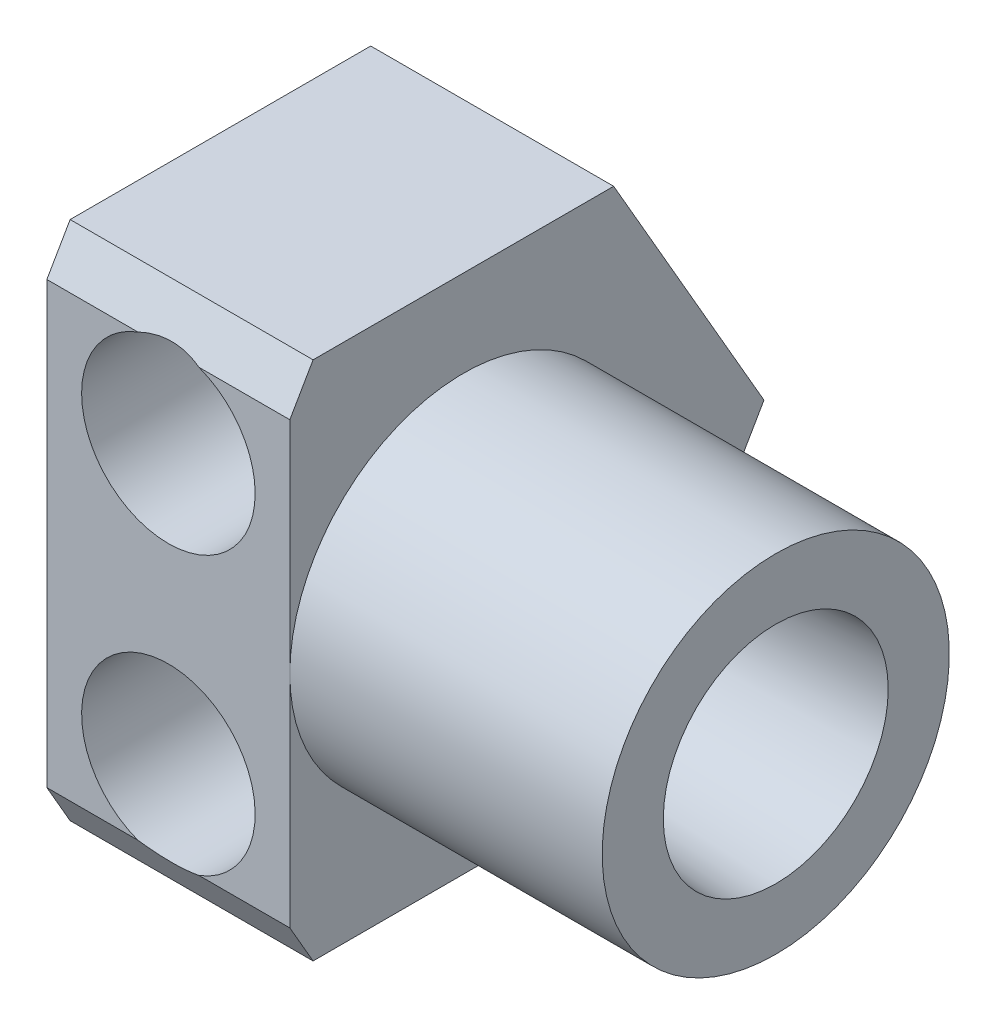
ISO-10303-21;
HEADER;
FILE_DESCRIPTION(('STEP AP214'),'2;1');
FILE_NAME('part.step','',(''),(''),'','','');
FILE_SCHEMA(('AUTOMOTIVE_DESIGN { 1 0 10303 214 1 1 1 1 }'));
ENDSEC;
DATA;
#1=APPLICATION_CONTEXT('core data for automotive mechanical design processes');
#2=APPLICATION_PROTOCOL_DEFINITION('international standard','automotive_design',2000,#1);
#3=PRODUCT_CONTEXT('',#1,'mechanical');
#4=PRODUCT('Part','Part','',(#3));
#5=PRODUCT_RELATED_PRODUCT_CATEGORY('part','',(#4));
#6=PRODUCT_DEFINITION_FORMATION('','',#4);
#7=PRODUCT_DEFINITION_CONTEXT('part definition',#1,'design');
#8=PRODUCT_DEFINITION('design','',#6,#7);
#9=PRODUCT_DEFINITION_SHAPE('','',#8);
#10=(LENGTH_UNIT() NAMED_UNIT(*) SI_UNIT(.MILLI.,.METRE.));
#11=(NAMED_UNIT(*) PLANE_ANGLE_UNIT() SI_UNIT($,.RADIAN.));
#12=(NAMED_UNIT(*) SI_UNIT($,.STERADIAN.) SOLID_ANGLE_UNIT());
#13=UNCERTAINTY_MEASURE_WITH_UNIT(LENGTH_MEASURE(1.E-05),#10,'distance_accuracy_value','');
#14=(GEOMETRIC_REPRESENTATION_CONTEXT(3) GLOBAL_UNCERTAINTY_ASSIGNED_CONTEXT((#13)) GLOBAL_UNIT_ASSIGNED_CONTEXT((#10,
#11,#12)) REPRESENTATION_CONTEXT('',''));
#15=CARTESIAN_POINT('',(0.,0.,0.));
#16=DIRECTION('',(0.,0.,1.));
#17=DIRECTION('',(1.,0.,0.));
#18=AXIS2_PLACEMENT_3D('',#15,#16,#17);
#19=CARTESIAN_POINT('',(5.56128060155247,6.34999999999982,-5.84535135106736));
#20=DIRECTION('',(0.,0.,1.));
#21=DIRECTION('',(0.,-1.,0.));
#22=AXIS2_PLACEMENT_3D('',#19,#20,#21);
#23=CONICAL_SURFACE('',#22,1.68719499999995,1.02747003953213);
#24=CARTESIAN_POINT('',(5.56128060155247,6.34999999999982,-6.86434989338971));
#25=VERTEX_POINT('',#24);
#26=VERTEX_LOOP('',#25);
#27=FACE_BOUND('',#26,.T.);
#28=CARTESIAN_POINT('',(5.56128060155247,6.34999999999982,-4.82635280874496));
#29=DIRECTION('',(0.,0.,-1.));
#30=DIRECTION('',(0.,-1.,0.));
#31=AXIS2_PLACEMENT_3D('',#28,#29,#30);
#32=CIRCLE('',#31,3.37438999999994);
#33=CARTESIAN_POINT('',(5.56128060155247,9.72438999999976,-4.82635280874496));
#34=VERTEX_POINT('',#33);
#35=EDGE_CURVE('E272',#34,#34,#32,.T.);
#36=ORIENTED_EDGE('',*,*,#35,.F.);
#37=EDGE_LOOP('',(#36));
#38=FACE_BOUND('',#37,.T.);
#39=ADVANCED_FACE('F16',(#27,#38),#23,.F.);
#40=CARTESIAN_POINT('',(5.56128060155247,-6.3500000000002,-5.84535135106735));
#41=DIRECTION('',(0.,0.,1.));
#42=DIRECTION('',(0.,-1.,0.));
#43=AXIS2_PLACEMENT_3D('',#40,#41,#42);
#44=CONICAL_SURFACE('',#43,1.68719499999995,1.02747003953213);
#45=CARTESIAN_POINT('',(5.56128060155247,-6.35000000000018,-6.8643498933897));
#46=VERTEX_POINT('',#45);
#47=VERTEX_LOOP('',#46);
#48=FACE_BOUND('',#47,.T.);
#49=CARTESIAN_POINT('',(5.56128060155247,-6.35000000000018,-4.82635280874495));
#50=DIRECTION('',(0.,0.,-1.));
#51=DIRECTION('',(0.,-1.,0.));
#52=AXIS2_PLACEMENT_3D('',#49,#50,#51);
#53=CIRCLE('',#52,3.37438999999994);
#54=CARTESIAN_POINT('',(5.56128060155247,-2.97561000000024,-4.82635280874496));
#55=VERTEX_POINT('',#54);
#56=EDGE_CURVE('E273',#55,#55,#53,.T.);
#57=ORIENTED_EDGE('',*,*,#56,.F.);
#58=EDGE_LOOP('',(#57));
#59=FACE_BOUND('',#58,.T.);
#60=ADVANCED_FACE('F329',(#48,#59),#44,.F.);
#61=CARTESIAN_POINT('',(11.1162606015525,0.,0.));
#62=DIRECTION('',(1.,0.,0.));
#63=DIRECTION('',(0.,-1.,0.));
#64=AXIS2_PLACEMENT_3D('',#61,#62,#63);
#65=CYLINDRICAL_SURFACE('',#64,7.9375);
#66=CARTESIAN_POINT('',(25.4037606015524,0.,0.));
#67=DIRECTION('',(-1.,0.,0.));
#68=DIRECTION('',(0.,-1.,0.));
#69=AXIS2_PLACEMENT_3D('',#66,#67,#68);
#70=CIRCLE('',#69,7.9375);
#71=CARTESIAN_POINT('',(25.4037606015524,-7.9375,0.));
#72=VERTEX_POINT('',#71);
#73=EDGE_CURVE('E11',#72,#72,#70,.T.);
#74=ORIENTED_EDGE('',*,*,#73,.T.);
#75=EDGE_LOOP('',(#74));
#76=FACE_BOUND('',#75,.T.);
#77=CARTESIAN_POINT('',(11.1162606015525,0.,0.));
#78=DIRECTION('',(-1.,0.,0.));
#79=DIRECTION('',(0.,-1.,0.));
#80=AXIS2_PLACEMENT_3D('',#77,#78,#79);
#81=CIRCLE('',#80,7.9375);
#82=CARTESIAN_POINT('',(11.1162606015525,0.,7.9375));
#83=VERTEX_POINT('',#82);
#84=EDGE_CURVE('E256',#83,#83,#81,.T.);
#85=ORIENTED_EDGE('',*,*,#84,.F.);
#86=EDGE_LOOP('',(#85));
#87=FACE_BOUND('',#86,.T.);
#88=ADVANCED_FACE('F335',(#76,#87),#65,.T.);
#89=CARTESIAN_POINT('',(0.00376060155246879,0.,-13.748153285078));
#90=DIRECTION('',(0.,-0.5,-0.866025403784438));
#91=DIRECTION('',(0.,0.866025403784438,-0.5));
#92=AXIS2_PLACEMENT_3D('',#89,#90,#91);
#93=PLANE('',#92);
#94=DIRECTION('',(0.,-0.866025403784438,0.5));
#95=VECTOR('',#94,1.);
#96=CARTESIAN_POINT('',(11.1162606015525,0.,-13.748153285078));
#97=LINE('',#96,#95);
#98=CARTESIAN_POINT('',(11.1162606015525,0.,-13.748153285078));
#99=VERTEX_POINT('',#98);
#100=CARTESIAN_POINT('',(11.1162606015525,-11.90625,-6.87407664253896));
#101=VERTEX_POINT('',#100);
#102=EDGE_CURVE('E29',#99,#101,#97,.T.);
#103=ORIENTED_EDGE('',*,*,#102,.T.);
#104=DIRECTION('',(1.,0.,0.));
#105=VECTOR('',#104,1.);
#106=CARTESIAN_POINT('',(0.00376060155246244,-11.90625,-6.87407664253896));
#107=LINE('',#106,#105);
#108=CARTESIAN_POINT('',(0.00376060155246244,-11.90625,-6.87407664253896));
#109=VERTEX_POINT('',#108);
#110=EDGE_CURVE('E257',#109,#101,#107,.T.);
#111=ORIENTED_EDGE('',*,*,#110,.F.);
#112=DIRECTION('',(0.,-0.866025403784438,0.5));
#113=VECTOR('',#112,1.);
#114=CARTESIAN_POINT('',(0.00376060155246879,0.,-13.748153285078));
#115=LINE('',#114,#113);
#116=CARTESIAN_POINT('',(0.00376060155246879,0.,-13.748153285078));
#117=VERTEX_POINT('',#116);
#118=EDGE_CURVE('E248',#117,#109,#115,.T.);
#119=ORIENTED_EDGE('',*,*,#118,.F.);
#120=DIRECTION('',(1.,0.,0.));
#121=VECTOR('',#120,1.);
#122=CARTESIAN_POINT('',(0.00376060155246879,0.,-13.748153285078));
#123=LINE('',#122,#121);
#124=EDGE_CURVE('E304',#117,#99,#123,.T.);
#125=ORIENTED_EDGE('',*,*,#124,.T.);
#126=EDGE_LOOP('',(#103,#111,#119,#125));
#127=FACE_BOUND('',#126,.T.);
#128=ADVANCED_FACE('F341',(#127),#93,.T.);
#129=CARTESIAN_POINT('',(0.00376060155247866,11.90625,-6.87407664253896));
#130=DIRECTION('',(0.,0.5,-0.866025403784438));
#131=DIRECTION('',(0.,0.866025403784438,0.5));
#132=AXIS2_PLACEMENT_3D('',#129,#130,#131);
#133=PLANE('',#132);
#134=DIRECTION('',(0.,-0.866025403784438,-0.5));
#135=VECTOR('',#134,1.);
#136=CARTESIAN_POINT('',(11.1162606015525,11.90625,-6.87407664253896));
#137=LINE('',#136,#135);
#138=CARTESIAN_POINT('',(11.1162606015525,11.90625,-6.87407664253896));
#139=VERTEX_POINT('',#138);
#140=EDGE_CURVE('E297',#139,#99,#137,.T.);
#141=ORIENTED_EDGE('',*,*,#140,.T.);
#142=ORIENTED_EDGE('',*,*,#124,.F.);
#143=DIRECTION('',(0.,-0.866025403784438,-0.5));
#144=VECTOR('',#143,1.);
#145=CARTESIAN_POINT('',(0.00376060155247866,11.90625,-6.87407664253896));
#146=LINE('',#145,#144);
#147=CARTESIAN_POINT('',(0.00376060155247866,11.90625,-6.87407664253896));
#148=VERTEX_POINT('',#147);
#149=EDGE_CURVE('E286',#148,#117,#146,.T.);
#150=ORIENTED_EDGE('',*,*,#149,.F.);
#151=DIRECTION('',(1.,0.,0.));
#152=VECTOR('',#151,1.);
#153=CARTESIAN_POINT('',(0.00376060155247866,11.90625,-6.87407664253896));
#154=LINE('',#153,#152);
#155=EDGE_CURVE('E294',#148,#139,#154,.T.);
#156=ORIENTED_EDGE('',*,*,#155,.T.);
#157=EDGE_LOOP('',(#141,#142,#150,#156));
#158=FACE_BOUND('',#157,.T.);
#159=ADVANCED_FACE('F345',(#158),#133,.T.);
#160=CARTESIAN_POINT('',(25.4037606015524,-0.72159090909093,0.));
#161=DIRECTION('',(1.,0.,0.));
#162=DIRECTION('',(0.,1.,0.));
#163=AXIS2_PLACEMENT_3D('',#160,#161,#162);
#164=PLANE('',#163);
#165=CARTESIAN_POINT('',(25.4037606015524,0.,0.));
#166=DIRECTION('',(-1.,0.,0.));
#167=DIRECTION('',(0.,-1.,0.));
#168=AXIS2_PLACEMENT_3D('',#165,#166,#167);
#169=CIRCLE('',#168,5.14350000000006);
#170=CARTESIAN_POINT('',(25.4037606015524,-5.14350000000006,0.));
#171=VERTEX_POINT('',#170);
#172=EDGE_CURVE('E290',#171,#171,#169,.T.);
#173=ORIENTED_EDGE('',*,*,#172,.T.);
#174=EDGE_LOOP('',(#173));
#175=FACE_BOUND('',#174,.T.);
#176=ORIENTED_EDGE('',*,*,#73,.F.);
#177=EDGE_LOOP('',(#176));
#178=FACE_BOUND('',#177,.T.);
#179=ADVANCED_FACE('F349',(#175,#178),#164,.T.);
#180=CARTESIAN_POINT('',(0.00376060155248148,11.90625,6.87407664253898));
#181=DIRECTION('',(0.,1.,0.));
#182=DIRECTION('',(-1.,0.,0.));
#183=AXIS2_PLACEMENT_3D('',#180,#181,#182);
#184=PLANE('',#183);
#185=DIRECTION('',(0.,0.,-1.));
#186=VECTOR('',#185,1.);
#187=CARTESIAN_POINT('',(11.1162606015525,11.90625,6.87407664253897));
#188=LINE('',#187,#186);
#189=CARTESIAN_POINT('',(11.1162606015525,11.90625,6.87407664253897));
#190=VERTEX_POINT('',#189);
#191=EDGE_CURVE('E281',#190,#139,#188,.T.);
#192=ORIENTED_EDGE('',*,*,#191,.T.);
#193=ORIENTED_EDGE('',*,*,#155,.F.);
#194=DIRECTION('',(0.,0.,-1.));
#195=VECTOR('',#194,1.);
#196=CARTESIAN_POINT('',(0.00376060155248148,11.90625,6.87407664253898));
#197=LINE('',#196,#195);
#198=CARTESIAN_POINT('',(0.00376060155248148,11.90625,6.87407664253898));
#199=VERTEX_POINT('',#198);
#200=EDGE_CURVE('E282',#199,#148,#197,.T.);
#201=ORIENTED_EDGE('',*,*,#200,.F.);
#202=DIRECTION('',(1.,0.,0.));
#203=VECTOR('',#202,1.);
#204=CARTESIAN_POINT('',(0.00376060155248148,11.90625,6.87407664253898));
#205=LINE('',#204,#203);
#206=EDGE_CURVE('E278',#199,#190,#205,.T.);
#207=ORIENTED_EDGE('',*,*,#206,.T.);
#208=EDGE_LOOP('',(#192,#193,#201,#207));
#209=FACE_BOUND('',#208,.T.);
#210=ADVANCED_FACE('F353',(#209),#184,.T.);
#211=CARTESIAN_POINT('',(5.56128060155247,6.34999999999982,-6.86434989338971));
#212=DIRECTION('',(0.,0.,1.));
#213=DIRECTION('',(0.,-1.,0.));
#214=AXIS2_PLACEMENT_3D('',#211,#212,#213);
#215=CYLINDRICAL_SURFACE('',#214,3.37438999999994);
#216=CARTESIAN_POINT('',(5.56128060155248,6.34999999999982,-3.20259964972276));
#217=DIRECTION('',(0.,0.,1.));
#218=DIRECTION('',(0.,-1.,0.));
#219=AXIS2_PLACEMENT_3D('',#216,#217,#218);
#220=CIRCLE('',#219,3.37438999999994);
#221=CARTESIAN_POINT('',(5.56128060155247,9.72438999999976,-3.20259964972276));
#222=VERTEX_POINT('',#221);
#223=EDGE_CURVE('E274',#222,#222,#220,.T.);
#224=ORIENTED_EDGE('',*,*,#223,.T.);
#225=EDGE_LOOP('',(#224));
#226=FACE_BOUND('',#225,.T.);
#227=ORIENTED_EDGE('',*,*,#35,.T.);
#228=EDGE_LOOP('',(#227));
#229=FACE_BOUND('',#228,.T.);
#230=ADVANCED_FACE('F326',(#226,#229),#215,.F.);
#231=CARTESIAN_POINT('',(5.56128060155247,-6.35000000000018,-6.8643498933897));
#232=DIRECTION('',(0.,0.,1.));
#233=DIRECTION('',(0.,-1.,0.));
#234=AXIS2_PLACEMENT_3D('',#231,#232,#233);
#235=CYLINDRICAL_SURFACE('',#234,3.37438999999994);
#236=CARTESIAN_POINT('',(5.56128060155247,-6.35000000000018,-3.20259964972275));
#237=DIRECTION('',(0.,0.,1.));
#238=DIRECTION('',(0.,-1.,0.));
#239=AXIS2_PLACEMENT_3D('',#236,#237,#238);
#240=CIRCLE('',#239,3.37438999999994);
#241=CARTESIAN_POINT('',(5.56128060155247,-2.97561000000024,-3.20259964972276));
#242=VERTEX_POINT('',#241);
#243=EDGE_CURVE('E268',#242,#242,#240,.T.);
#244=ORIENTED_EDGE('',*,*,#243,.T.);
#245=EDGE_LOOP('',(#244));
#246=FACE_BOUND('',#245,.T.);
#247=ORIENTED_EDGE('',*,*,#56,.T.);
#248=EDGE_LOOP('',(#247));
#249=FACE_BOUND('',#248,.T.);
#250=ADVANCED_FACE('F360',(#246,#249),#235,.F.);
#251=CARTESIAN_POINT('',(11.1162606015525,0.,-1.16213065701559));
#252=DIRECTION('',(1.,0.,0.));
#253=DIRECTION('',(0.,1.,0.));
#254=AXIS2_PLACEMENT_3D('',#251,#252,#253);
#255=PLANE('',#254);
#256=ORIENTED_EDGE('',*,*,#140,.F.);
#257=ORIENTED_EDGE('',*,*,#191,.F.);
#258=DIRECTION('',(0.,0.866025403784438,-0.5));
#259=VECTOR('',#258,1.);
#260=CARTESIAN_POINT('',(11.1162606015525,10.064346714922,7.9375));
#261=LINE('',#260,#259);
#262=CARTESIAN_POINT('',(11.1162606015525,10.064346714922,7.9375));
#263=VERTEX_POINT('',#262);
#264=EDGE_CURVE('E219',#263,#190,#261,.T.);
#265=ORIENTED_EDGE('',*,*,#264,.F.);
#266=DIRECTION('',(0.,1.,0.));
#267=VECTOR('',#266,1.);
#268=CARTESIAN_POINT('',(11.1162606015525,-10.064346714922,7.9375));
#269=LINE('',#268,#267);
#270=EDGE_CURVE('E198',#83,#263,#269,.T.);
#271=ORIENTED_EDGE('',*,*,#270,.F.);
#272=ORIENTED_EDGE('',*,*,#84,.T.);
#273=DIRECTION('',(0.,1.,0.));
#274=VECTOR('',#273,1.);
#275=CARTESIAN_POINT('',(11.1162606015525,-10.064346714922,7.9375));
#276=LINE('',#275,#274);
#277=CARTESIAN_POINT('',(11.1162606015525,-10.064346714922,7.9375));
#278=VERTEX_POINT('',#277);
#279=EDGE_CURVE('E204',#278,#83,#276,.T.);
#280=ORIENTED_EDGE('',*,*,#279,.F.);
#281=DIRECTION('',(0.,0.866025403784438,0.5));
#282=VECTOR('',#281,1.);
#283=CARTESIAN_POINT('',(11.1162606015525,-11.90625,6.87407664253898));
#284=LINE('',#283,#282);
#285=CARTESIAN_POINT('',(11.1162606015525,-11.90625,6.87407664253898));
#286=VERTEX_POINT('',#285);
#287=EDGE_CURVE('E232',#286,#278,#284,.T.);
#288=ORIENTED_EDGE('',*,*,#287,.F.);
#289=DIRECTION('',(0.,0.,1.));
#290=VECTOR('',#289,1.);
#291=CARTESIAN_POINT('',(11.1162606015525,-11.90625,-6.87407664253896));
#292=LINE('',#291,#290);
#293=EDGE_CURVE('E252',#101,#286,#292,.T.);
#294=ORIENTED_EDGE('',*,*,#293,.F.);
#295=ORIENTED_EDGE('',*,*,#102,.F.);
#296=EDGE_LOOP('',(#256,#257,#265,#271,#272,#280,#288,#294,#295));
#297=FACE_BOUND('',#296,.T.);
#298=ADVANCED_FACE('F364',(#297),#255,.T.);
#299=CARTESIAN_POINT('',(0.00376060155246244,-11.90625,-6.87407664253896));
#300=DIRECTION('',(0.,-1.,0.));
#301=DIRECTION('',(1.,0.,0.));
#302=AXIS2_PLACEMENT_3D('',#299,#300,#301);
#303=PLANE('',#302);
#304=ORIENTED_EDGE('',*,*,#293,.T.);
#305=DIRECTION('',(1.,0.,0.));
#306=VECTOR('',#305,1.);
#307=CARTESIAN_POINT('',(0.00376060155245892,-11.90625,6.87407664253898));
#308=LINE('',#307,#306);
#309=CARTESIAN_POINT('',(0.00376060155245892,-11.90625,6.87407664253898));
#310=VERTEX_POINT('',#309);
#311=EDGE_CURVE('E191',#310,#286,#308,.T.);
#312=ORIENTED_EDGE('',*,*,#311,.F.);
#313=DIRECTION('',(0.,0.,1.));
#314=VECTOR('',#313,1.);
#315=CARTESIAN_POINT('',(0.00376060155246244,-11.90625,-6.87407664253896));
#316=LINE('',#315,#314);
#317=EDGE_CURVE('E244',#109,#310,#316,.T.);
#318=ORIENTED_EDGE('',*,*,#317,.F.);
#319=ORIENTED_EDGE('',*,*,#110,.T.);
#320=EDGE_LOOP('',(#304,#312,#318,#319));
#321=FACE_BOUND('',#320,.T.);
#322=ADVANCED_FACE('F368',(#321),#303,.T.);
#323=CARTESIAN_POINT('',(0.00376060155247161,0.,-1.16213065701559));
#324=DIRECTION('',(1.,0.,0.));
#325=DIRECTION('',(0.,1.,0.));
#326=AXIS2_PLACEMENT_3D('',#323,#324,#325);
#327=PLANE('',#326);
#328=ORIENTED_EDGE('',*,*,#200,.T.);
#329=ORIENTED_EDGE('',*,*,#149,.T.);
#330=ORIENTED_EDGE('',*,*,#118,.T.);
#331=ORIENTED_EDGE('',*,*,#317,.T.);
#332=DIRECTION('',(0.,0.866025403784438,0.5));
#333=VECTOR('',#332,1.);
#334=CARTESIAN_POINT('',(0.00376060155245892,-11.90625,6.87407664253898));
#335=LINE('',#334,#333);
#336=CARTESIAN_POINT('',(0.00376060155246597,-10.064346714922,7.9375));
#337=VERTEX_POINT('',#336);
#338=EDGE_CURVE('E240',#310,#337,#335,.T.);
#339=ORIENTED_EDGE('',*,*,#338,.T.);
#340=DIRECTION('',(0.,1.,0.));
#341=VECTOR('',#340,1.);
#342=CARTESIAN_POINT('',(0.00376060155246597,-10.064346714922,7.9375));
#343=LINE('',#342,#341);
#344=CARTESIAN_POINT('',(0.00376060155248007,10.064346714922,7.9375));
#345=VERTEX_POINT('',#344);
#346=EDGE_CURVE('E236',#337,#345,#343,.T.);
#347=ORIENTED_EDGE('',*,*,#346,.T.);
#348=DIRECTION('',(0.,0.866025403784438,-0.5));
#349=VECTOR('',#348,1.);
#350=CARTESIAN_POINT('',(0.00376060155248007,10.064346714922,7.9375));
#351=LINE('',#350,#349);
#352=EDGE_CURVE('E228',#345,#199,#351,.T.);
#353=ORIENTED_EDGE('',*,*,#352,.T.);
#354=EDGE_LOOP('',(#328,#329,#330,#331,#339,#347,#353));
#355=FACE_BOUND('',#354,.T.);
#356=ADVANCED_FACE('F372',(#355),#327,.F.);
#357=CARTESIAN_POINT('',(25.4037606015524,0.,0.));
#358=DIRECTION('',(1.,0.,0.));
#359=DIRECTION('',(0.,-1.,0.));
#360=AXIS2_PLACEMENT_3D('',#357,#358,#359);
#361=CONICAL_SURFACE('',#360,5.14350000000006,0.0523598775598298);
#362=CARTESIAN_POINT('',(16.5899606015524,0.,0.));
#363=DIRECTION('',(1.,0.,0.));
#364=DIRECTION('',(0.,-1.,0.));
#365=AXIS2_PLACEMENT_3D('',#362,#363,#364);
#366=CIRCLE('',#365,4.68158831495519);
#367=CARTESIAN_POINT('',(16.5899606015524,-4.68158831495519,0.));
#368=VERTEX_POINT('',#367);
#369=EDGE_CURVE('E182',#368,#368,#366,.T.);
#370=ORIENTED_EDGE('',*,*,#369,.F.);
#371=EDGE_LOOP('',(#370));
#372=FACE_BOUND('',#371,.T.);
#373=ORIENTED_EDGE('',*,*,#172,.F.);
#374=EDGE_LOOP('',(#373));
#375=FACE_BOUND('',#374,.T.);
#376=ADVANCED_FACE('F376',(#372,#375),#361,.F.);
#377=CARTESIAN_POINT('',(0.00376060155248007,10.064346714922,7.9375));
#378=DIRECTION('',(0.,0.5,0.866025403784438));
#379=DIRECTION('',(0.,-0.866025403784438,0.5));
#380=AXIS2_PLACEMENT_3D('',#377,#378,#379);
#381=PLANE('',#380);
#382=CARTESIAN_POINT('',(5.56128060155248,6.35,10.0819790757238));
#383=DIRECTION('',(0.,-0.5,-0.866025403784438));
#384=DIRECTION('',(0.,-0.866025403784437,0.5));
#385=AXIS2_PLACEMENT_3D('',#382,#383,#384);
#386=ELLIPSE('',#385,4.58271776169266,3.96875);
#387=CARTESIAN_POINT('',(4.16320869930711,10.064346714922,7.9375));
#388=VERTEX_POINT('',#387);
#389=CARTESIAN_POINT('',(6.95935250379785,10.064346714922,7.9375));
#390=VERTEX_POINT('',#389);
#391=EDGE_CURVE('E224',#388,#390,#386,.T.);
#392=ORIENTED_EDGE('',*,*,#391,.T.);
#393=DIRECTION('',(1.,0.,0.));
#394=VECTOR('',#393,1.);
#395=CARTESIAN_POINT('',(0.00376060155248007,10.064346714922,7.9375));
#396=LINE('',#395,#394);
#397=EDGE_CURVE('E220',#390,#263,#396,.T.);
#398=ORIENTED_EDGE('',*,*,#397,.T.);
#399=ORIENTED_EDGE('',*,*,#264,.T.);
#400=ORIENTED_EDGE('',*,*,#206,.F.);
#401=ORIENTED_EDGE('',*,*,#352,.F.);
#402=DIRECTION('',(1.,0.,0.));
#403=VECTOR('',#402,1.);
#404=CARTESIAN_POINT('',(0.00376060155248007,10.064346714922,7.9375));
#405=LINE('',#404,#403);
#406=EDGE_CURVE('E216',#345,#388,#405,.T.);
#407=ORIENTED_EDGE('',*,*,#406,.T.);
#408=EDGE_LOOP('',(#392,#398,#399,#400,#401,#407));
#409=FACE_BOUND('',#408,.T.);
#410=ADVANCED_FACE('F380',(#409),#381,.T.);
#411=CARTESIAN_POINT('',(5.56128060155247,5.98920454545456,-3.20259964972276));
#412=DIRECTION('',(0.,0.,-1.));
#413=DIRECTION('',(-1.,0.,0.));
#414=AXIS2_PLACEMENT_3D('',#411,#412,#413);
#415=PLANE('',#414);
#416=ORIENTED_EDGE('',*,*,#223,.F.);
#417=EDGE_LOOP('',(#416));
#418=FACE_BOUND('',#417,.T.);
#419=CARTESIAN_POINT('',(5.56128060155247,6.35,-3.20259964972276));
#420=DIRECTION('',(0.,0.,1.));
#421=DIRECTION('',(0.,-1.,0.));
#422=AXIS2_PLACEMENT_3D('',#419,#420,#421);
#423=CIRCLE('',#422,3.96875);
#424=CARTESIAN_POINT('',(5.56128060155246,2.38125,-3.20259964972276));
#425=VERTEX_POINT('',#424);
#426=EDGE_CURVE('E212',#425,#425,#423,.T.);
#427=ORIENTED_EDGE('',*,*,#426,.T.);
#428=EDGE_LOOP('',(#427));
#429=FACE_BOUND('',#428,.T.);
#430=ADVANCED_FACE('F384',(#418,#429),#415,.F.);
#431=CARTESIAN_POINT('',(5.56128060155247,-6.71079545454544,-3.20259964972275));
#432=DIRECTION('',(0.,0.,-1.));
#433=DIRECTION('',(-1.,0.,0.));
#434=AXIS2_PLACEMENT_3D('',#431,#432,#433);
#435=PLANE('',#434);
#436=ORIENTED_EDGE('',*,*,#243,.F.);
#437=EDGE_LOOP('',(#436));
#438=FACE_BOUND('',#437,.T.);
#439=CARTESIAN_POINT('',(5.56128060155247,-6.35,-3.20259964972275));
#440=DIRECTION('',(0.,0.,1.));
#441=DIRECTION('',(0.,-1.,0.));
#442=AXIS2_PLACEMENT_3D('',#439,#440,#441);
#443=CIRCLE('',#442,3.96875);
#444=CARTESIAN_POINT('',(5.56128060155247,-10.31875,-3.20259964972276));
#445=VERTEX_POINT('',#444);
#446=EDGE_CURVE('E208',#445,#445,#443,.T.);
#447=ORIENTED_EDGE('',*,*,#446,.T.);
#448=EDGE_LOOP('',(#447));
#449=FACE_BOUND('',#448,.T.);
#450=ADVANCED_FACE('F388',(#438,#449),#435,.F.);
#451=CARTESIAN_POINT('',(0.00376060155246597,-10.064346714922,7.9375));
#452=DIRECTION('',(0.,0.,1.));
#453=DIRECTION('',(1.,0.,0.));
#454=AXIS2_PLACEMENT_3D('',#451,#452,#453);
#455=PLANE('',#454);
#456=CARTESIAN_POINT('',(5.56128060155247,-6.35,7.9375));
#457=DIRECTION('',(0.,0.,-1.));
#458=DIRECTION('',(0.,-1.,0.));
#459=AXIS2_PLACEMENT_3D('',#456,#457,#458);
#460=CIRCLE('',#459,3.96875);
#461=CARTESIAN_POINT('',(4.1632086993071,-10.064346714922,7.9375));
#462=VERTEX_POINT('',#461);
#463=CARTESIAN_POINT('',(6.95935250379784,-10.064346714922,7.9375));
#464=VERTEX_POINT('',#463);
#465=EDGE_CURVE('E203',#462,#464,#460,.T.);
#466=ORIENTED_EDGE('',*,*,#465,.T.);
#467=DIRECTION('',(1.,0.,0.));
#468=VECTOR('',#467,1.);
#469=CARTESIAN_POINT('',(0.00376060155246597,-10.064346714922,7.9375));
#470=LINE('',#469,#468);
#471=EDGE_CURVE('E199',#464,#278,#470,.T.);
#472=ORIENTED_EDGE('',*,*,#471,.T.);
#473=ORIENTED_EDGE('',*,*,#279,.T.);
#474=ORIENTED_EDGE('',*,*,#270,.T.);
#475=ORIENTED_EDGE('',*,*,#397,.F.);
#476=CARTESIAN_POINT('',(5.56128060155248,6.35,7.9375));
#477=DIRECTION('',(0.,0.,-1.));
#478=DIRECTION('',(0.,-1.,0.));
#479=AXIS2_PLACEMENT_3D('',#476,#477,#478);
#480=CIRCLE('',#479,3.96875);
#481=EDGE_CURVE('E194',#390,#388,#480,.T.);
#482=ORIENTED_EDGE('',*,*,#481,.T.);
#483=ORIENTED_EDGE('',*,*,#406,.F.);
#484=ORIENTED_EDGE('',*,*,#346,.F.);
#485=DIRECTION('',(1.,0.,0.));
#486=VECTOR('',#485,1.);
#487=CARTESIAN_POINT('',(0.00376060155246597,-10.064346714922,7.9375));
#488=LINE('',#487,#486);
#489=EDGE_CURVE('E190',#337,#462,#488,.T.);
#490=ORIENTED_EDGE('',*,*,#489,.T.);
#491=EDGE_LOOP('',(#466,#472,#473,#474,#475,#482,#483,#484,#490));
#492=FACE_BOUND('',#491,.T.);
#493=ADVANCED_FACE('F392',(#492),#455,.T.);
#494=CARTESIAN_POINT('',(0.00376060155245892,-11.90625,6.87407664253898));
#495=DIRECTION('',(0.,-0.5,0.866025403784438));
#496=DIRECTION('',(0.,-0.866025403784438,-0.5));
#497=AXIS2_PLACEMENT_3D('',#494,#495,#496);
#498=PLANE('',#497);
#499=CARTESIAN_POINT('',(5.56128060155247,-6.35,10.0819790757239));
#500=DIRECTION('',(0.,0.5,-0.866025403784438));
#501=DIRECTION('',(0.,-0.866025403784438,-0.5));
#502=AXIS2_PLACEMENT_3D('',#499,#500,#501);
#503=ELLIPSE('',#502,4.58271776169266,3.96875);
#504=EDGE_CURVE('E186',#464,#462,#503,.T.);
#505=ORIENTED_EDGE('',*,*,#504,.T.);
#506=ORIENTED_EDGE('',*,*,#489,.F.);
#507=ORIENTED_EDGE('',*,*,#338,.F.);
#508=ORIENTED_EDGE('',*,*,#311,.T.);
#509=ORIENTED_EDGE('',*,*,#287,.T.);
#510=ORIENTED_EDGE('',*,*,#471,.F.);
#511=EDGE_LOOP('',(#505,#506,#507,#508,#509,#510));
#512=FACE_BOUND('',#511,.T.);
#513=ADVANCED_FACE('F396',(#512),#498,.T.);
#514=CARTESIAN_POINT('',(16.5899606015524,-5.14350000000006,0.));
#515=DIRECTION('',(1.,0.,0.));
#516=DIRECTION('',(0.,1.,0.));
#517=AXIS2_PLACEMENT_3D('',#514,#515,#516);
#518=PLANE('',#517);
#519=CARTESIAN_POINT('',(16.5899606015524,0.,0.));
#520=DIRECTION('',(1.,0.,0.));
#521=DIRECTION('',(0.,-1.,0.));
#522=AXIS2_PLACEMENT_3D('',#519,#520,#521);
#523=CIRCLE('',#522,3.175);
#524=CARTESIAN_POINT('',(16.5899606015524,-3.175,0.));
#525=VERTEX_POINT('',#524);
#526=EDGE_CURVE('E140',#525,#525,#523,.T.);
#527=ORIENTED_EDGE('',*,*,#526,.F.);
#528=EDGE_LOOP('',(#527));
#529=FACE_BOUND('',#528,.T.);
#530=ORIENTED_EDGE('',*,*,#369,.T.);
#531=EDGE_LOOP('',(#530));
#532=FACE_BOUND('',#531,.T.);
#533=ADVANCED_FACE('F399',(#529,#532),#518,.T.);
#534=CARTESIAN_POINT('',(2.39136060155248,-0.288636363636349,0.));
#535=DIRECTION('',(1.,0.,0.));
#536=DIRECTION('',(0.,1.,0.));
#537=AXIS2_PLACEMENT_3D('',#534,#535,#536);
#538=PLANE('',#537);
#539=CARTESIAN_POINT('',(2.39136060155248,0.,0.));
#540=DIRECTION('',(1.,0.,0.));
#541=DIRECTION('',(0.,-1.,0.));
#542=AXIS2_PLACEMENT_3D('',#539,#540,#541);
#543=CIRCLE('',#542,3.175);
#544=CARTESIAN_POINT('',(2.39136060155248,-3.175,0.));
#545=VERTEX_POINT('',#544);
#546=EDGE_CURVE('E178',#545,#545,#543,.T.);
#547=ORIENTED_EDGE('',*,*,#546,.T.);
#548=EDGE_LOOP('',(#547));
#549=FACE_BOUND('',#548,.T.);
#550=ADVANCED_FACE('F158',(#549),#538,.T.);
#551=CARTESIAN_POINT('',(5.56128060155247,6.35,-3.20259964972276));
#552=DIRECTION('',(0.,0.,1.));
#553=DIRECTION('',(0.,-1.,0.));
#554=AXIS2_PLACEMENT_3D('',#551,#552,#553);
#555=CYLINDRICAL_SURFACE('',#554,3.96875);
#556=CARTESIAN_POINT('',(5.56128060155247,2.38125,-2.10006510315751));
#557=CARTESIAN_POINT('',(5.594808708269,2.38124937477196,-2.1000653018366));
#558=CARTESIAN_POINT('',(5.62833692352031,2.3816748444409,-2.09957769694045));
#559=CARTESIAN_POINT('',(5.69531207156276,2.38337273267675,-2.0976268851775));
#560=CARTESIAN_POINT('',(5.72875905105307,2.38464435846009,-2.09616459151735));
#561=CARTESIAN_POINT('',(5.79555025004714,2.38802918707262,-2.09226457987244));
#562=CARTESIAN_POINT('',(5.82889447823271,2.3901423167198,-2.08982694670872));
#563=CARTESIAN_POINT('',(5.89546036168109,2.39520351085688,-2.08397702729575));
#564=CARTESIAN_POINT('',(5.92868190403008,2.39815221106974,-2.08056399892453));
#565=CARTESIAN_POINT('',(5.97838277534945,2.40319367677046,-2.07471722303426));
#566=CARTESIAN_POINT('',(5.99493726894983,2.40497843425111,-2.07264569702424));
#567=CARTESIAN_POINT('',(6.02891565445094,2.40885771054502,-2.06813840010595));
#568=CARTESIAN_POINT('',(6.04633636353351,2.41096397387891,-2.06568873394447));
#569=CARTESIAN_POINT('',(6.09814410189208,2.41757606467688,-2.05797935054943));
#570=CARTESIAN_POINT('',(6.13243096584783,2.42241098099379,-2.05231801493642));
#571=CARTESIAN_POINT('',(6.20023453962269,2.43287398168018,-2.03995936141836));
#572=CARTESIAN_POINT('',(6.23375549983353,2.43849120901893,-2.03327611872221));
#573=CARTESIAN_POINT('',(6.30001401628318,2.45046548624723,-2.01887366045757));
#574=CARTESIAN_POINT('',(6.33275614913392,2.4568130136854,-2.01116761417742));
#575=CARTESIAN_POINT('',(6.39744519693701,2.47019531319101,-1.99472259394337));
#576=CARTESIAN_POINT('',(6.42939688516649,2.47722188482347,-1.98599572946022));
#577=CARTESIAN_POINT('',(6.4936575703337,2.49218104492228,-1.96716172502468));
#578=CARTESIAN_POINT('',(6.52595306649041,2.50013291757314,-1.95702377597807));
#579=CARTESIAN_POINT('',(6.58973016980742,2.51667953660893,-1.93560952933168));
#580=CARTESIAN_POINT('',(6.62121589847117,2.52526937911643,-1.92434172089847));
#581=CARTESIAN_POINT('',(6.68336702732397,2.54304093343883,-1.90067125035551));
#582=CARTESIAN_POINT('',(6.71403608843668,2.55221898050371,-1.88827544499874));
#583=CARTESIAN_POINT('',(6.77455087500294,2.57111761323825,-1.86235031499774));
#584=CARTESIAN_POINT('',(6.80439961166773,2.58083565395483,-1.84882617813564));
#585=CARTESIAN_POINT('',(6.84858008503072,2.59579199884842,-1.82767572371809));
#586=CARTESIAN_POINT('',(6.86319122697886,2.60083448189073,-1.82049052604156));
#587=CARTESIAN_POINT('',(6.89259339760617,2.61117240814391,-1.80564723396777));
#588=CARTESIAN_POINT('',(6.90737958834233,2.6164710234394,-1.797981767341));
#589=CARTESIAN_POINT('',(6.95086046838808,2.63234163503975,-1.77482704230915));
#590=CARTESIAN_POINT('',(6.97926150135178,2.64308649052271,-1.75890041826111));
#591=CARTESIAN_POINT('',(7.03447769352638,2.66468809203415,-1.72620834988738));
#592=CARTESIAN_POINT('',(7.06131472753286,2.67553540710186,-1.70947362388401));
#593=CARTESIAN_POINT('',(7.11342502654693,2.69724733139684,-1.6751650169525));
#594=CARTESIAN_POINT('',(7.13872028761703,2.70810542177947,-1.6576204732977));
#595=CARTESIAN_POINT('',(7.18777520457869,2.72975221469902,-1.6216996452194));
#596=CARTESIAN_POINT('',(7.2115565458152,2.74053704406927,-1.60335071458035));
#597=CARTESIAN_POINT('',(7.25942137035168,2.76279608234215,-1.56431040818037));
#598=CARTESIAN_POINT('',(7.28344262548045,2.77427405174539,-1.54354491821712));
#599=CARTESIAN_POINT('',(7.33730122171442,2.80065158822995,-1.49443500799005));
#600=CARTESIAN_POINT('',(7.36675158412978,2.81555673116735,-1.46566879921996));
#601=CARTESIAN_POINT('',(7.41276688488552,2.83953536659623,-1.4179166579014));
#602=CARTESIAN_POINT('',(7.42989299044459,2.84862489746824,-1.39947259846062));
#603=CARTESIAN_POINT('',(7.46881323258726,2.86963661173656,-1.35592470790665));
#604=CARTESIAN_POINT('',(7.49034933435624,2.88153538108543,-1.33057686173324));
#605=CARTESIAN_POINT('',(7.52163308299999,2.89918320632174,-1.29182923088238));
#606=CARTESIAN_POINT('',(7.53185373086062,2.90501049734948,-1.27884345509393));
#607=CARTESIAN_POINT('',(7.55162175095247,2.91639484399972,-1.25301856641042));
#608=CARTESIAN_POINT('',(7.5611802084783,2.92195442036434,-1.2401890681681));
#609=CARTESIAN_POINT('',(7.58926015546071,2.93843942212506,-1.20137496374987));
#610=CARTESIAN_POINT('',(7.6072732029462,2.94922039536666,-1.17495771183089));
#611=CARTESIAN_POINT('',(7.6418556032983,2.97026737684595,-1.12113728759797));
#612=CARTESIAN_POINT('',(7.65842956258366,2.98053497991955,-1.0937376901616));
#613=CARTESIAN_POINT('',(7.69016876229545,3.00049809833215,-1.03795171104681));
#614=CARTESIAN_POINT('',(7.70533471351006,3.0101939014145,-1.00956583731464));
#615=CARTESIAN_POINT('',(7.73428004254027,3.02895368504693,-0.951804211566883));
#616=CARTESIAN_POINT('',(7.74805610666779,3.03801614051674,-0.922426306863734));
#617=CARTESIAN_POINT('',(7.7748684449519,3.05587235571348,-0.861422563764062));
#618=CARTESIAN_POINT('',(7.7878365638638,3.06463183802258,-0.82975676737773));
#619=CARTESIAN_POINT('',(7.8121297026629,3.08122823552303,-0.765967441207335));
#620=CARTESIAN_POINT('',(7.82347056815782,3.08907388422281,-0.733852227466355));
#621=CARTESIAN_POINT('',(7.84453048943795,3.10378520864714,-0.669159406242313));
#622=CARTESIAN_POINT('',(7.85426133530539,3.11065794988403,-0.636587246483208));
#623=CARTESIAN_POINT('',(7.87214133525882,3.12338891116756,-0.570984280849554));
#624=CARTESIAN_POINT('',(7.88029771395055,3.12925175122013,-0.53795635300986));
#625=CARTESIAN_POINT('',(7.89135951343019,3.13725515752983,-0.488060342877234));
#626=CARTESIAN_POINT('',(7.89484911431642,3.13978952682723,-0.471382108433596));
#627=CARTESIAN_POINT('',(7.90144971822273,3.14459804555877,-0.437953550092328));
#628=CARTESIAN_POINT('',(7.90456155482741,3.14687276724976,-0.421203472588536));
#629=CARTESIAN_POINT('',(7.91332413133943,3.15329541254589,-0.371016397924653));
#630=CARTESIAN_POINT('',(7.9184469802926,3.15707452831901,-0.337437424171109));
#631=CARTESIAN_POINT('',(7.92720884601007,3.16356159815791,-0.270186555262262));
#632=CARTESIAN_POINT('',(7.93085638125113,3.16627569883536,-0.236516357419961));
#633=CARTESIAN_POINT('',(7.93668588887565,3.17062278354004,-0.169083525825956));
#634=CARTESIAN_POINT('',(7.93887231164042,3.17225905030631,-0.135321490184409));
#635=CARTESIAN_POINT('',(7.94179174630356,3.1744454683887,-0.067706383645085));
#636=CARTESIAN_POINT('',(7.94252504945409,3.17499583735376,-0.0338533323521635));
#637=CARTESIAN_POINT('',(7.94253614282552,3.17500415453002,0.0337873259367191));
#638=CARTESIAN_POINT('',(7.94181676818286,3.17446423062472,0.0675749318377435));
#639=CARTESIAN_POINT('',(7.93891632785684,3.17229199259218,0.135096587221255));
#640=CARTESIAN_POINT('',(7.93673334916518,3.17065824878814,0.168830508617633));
#641=CARTESIAN_POINT('',(7.9309067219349,3.16631316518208,0.236244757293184));
#642=CARTESIAN_POINT('',(7.92725697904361,3.1635973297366,0.269924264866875));
#643=CARTESIAN_POINT('',(7.91848509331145,3.15710265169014,0.337231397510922));
#644=CARTESIAN_POINT('',(7.91335278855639,3.1533164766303,0.370856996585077));
#645=CARTESIAN_POINT('',(7.90457527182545,3.14688279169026,0.421128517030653));
#646=CARTESIAN_POINT('',(7.9014568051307,3.14460320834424,0.437916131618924));
#647=CARTESIAN_POINT('',(7.89485049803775,3.13979053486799,0.471376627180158));
#648=CARTESIAN_POINT('',(7.89136277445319,3.13725752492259,0.488049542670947));
#649=CARTESIAN_POINT('',(7.88030526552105,3.12925719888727,0.537933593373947));
#650=CARTESIAN_POINT('',(7.87215067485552,3.1233956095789,0.570954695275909));
#651=CARTESIAN_POINT('',(7.85427311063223,3.11066628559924,0.636549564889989));
#652=CARTESIAN_POINT('',(7.84454265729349,3.10379376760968,0.669120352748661));
#653=CARTESIAN_POINT('',(7.82348192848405,3.08908176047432,0.733815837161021));
#654=CARTESIAN_POINT('',(7.81213960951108,3.08123505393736,0.765934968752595));
#655=CARTESIAN_POINT('',(7.78784250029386,3.06463584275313,0.829737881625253));
#656=CARTESIAN_POINT('',(7.77487163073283,3.05587447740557,0.861413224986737));
#657=CARTESIAN_POINT('',(7.74806043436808,3.03801902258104,0.922418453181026));
#658=CARTESIAN_POINT('',(7.73428907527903,3.02895962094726,0.951788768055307));
#659=CARTESIAN_POINT('',(7.70535047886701,3.01020403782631,1.00953951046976));
#660=CARTESIAN_POINT('',(7.69018633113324,3.00050927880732,1.03792194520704));
#661=CARTESIAN_POINT('',(7.6584485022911,2.98054676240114,1.09370569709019));
#662=CARTESIAN_POINT('',(7.64187388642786,2.97027862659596,1.12110634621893));
#663=CARTESIAN_POINT('',(7.60728762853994,2.94922905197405,1.17493334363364));
#664=CARTESIAN_POINT('',(7.58927116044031,2.93844594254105,1.20135594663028));
#665=CARTESIAN_POINT('',(7.56118553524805,2.92195751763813,1.24018024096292));
#666=CARTESIAN_POINT('',(7.55162450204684,2.91639642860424,1.25301422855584));
#667=CARTESIAN_POINT('',(7.53186016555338,2.90501420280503,1.27883581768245));
#668=CARTESIAN_POINT('',(7.52164607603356,2.89919061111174,1.29181406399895));
#669=CARTESIAN_POINT('',(7.49037105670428,2.8815474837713,1.33055220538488));
#670=CARTESIAN_POINT('',(7.46883631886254,2.86964928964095,1.35589723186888));
#671=CARTESIAN_POINT('',(7.42990999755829,2.84863391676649,1.399453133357));
#672=CARTESIAN_POINT('',(7.41277565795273,2.83953993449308,1.4179072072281));
#673=CARTESIAN_POINT('',(7.36676151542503,2.81556191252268,1.46565905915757));
#674=CARTESIAN_POINT('',(7.3373211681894,2.80066168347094,1.49441549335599));
#675=CARTESIAN_POINT('',(7.28346346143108,2.77428400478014,1.54352630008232));
#676=CARTESIAN_POINT('',(7.25943187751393,2.7628009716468,1.56430113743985));
#677=CARTESIAN_POINT('',(7.21156440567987,2.74054069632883,1.60334496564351));
#678=CARTESIAN_POINT('',(7.1877915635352,2.72975962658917,1.62168902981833));
#679=CARTESIAN_POINT('',(7.13874880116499,2.7081178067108,1.65760271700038));
#680=CARTESIAN_POINT('',(7.11345700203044,2.69726094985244,1.67514473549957));
#681=CARTESIAN_POINT('',(7.06134921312,2.67554947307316,1.70945173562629));
#682=CARTESIAN_POINT('',(7.03451106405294,2.66470142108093,1.72618716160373));
#683=CARTESIAN_POINT('',(6.97928789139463,2.64309653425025,1.75888374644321));
#684=CARTESIAN_POINT('',(6.95088084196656,2.632349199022,1.7748139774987));
#685=CARTESIAN_POINT('',(6.90738926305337,2.61647448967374,1.79797572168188));
#686=CARTESIAN_POINT('',(6.89259827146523,2.61117412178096,1.80564426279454));
#687=CARTESIAN_POINT('',(6.86319641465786,2.60083630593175,1.82048840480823));
#688=CARTESIAN_POINT('',(6.84859051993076,2.59579559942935,1.82767157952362));
#689=CARTESIAN_POINT('',(6.80442196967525,2.58084308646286,1.84881759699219));
#690=CARTESIAN_POINT('',(6.7745797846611,2.57112695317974,1.86233898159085));
#691=CARTESIAN_POINT('',(6.71407305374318,2.55223021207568,1.88826097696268));
#692=CARTESIAN_POINT('',(6.6834053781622,2.54305224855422,1.90065619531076));
#693=CARTESIAN_POINT('',(6.62125177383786,2.52527928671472,1.9243276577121));
#694=CARTESIAN_POINT('',(6.58976207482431,2.51668806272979,1.93559684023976));
#695=CARTESIAN_POINT('',(6.52597181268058,2.50013753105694,1.95701648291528));
#696=CARTESIAN_POINT('',(6.49366703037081,2.49218324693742,1.96715825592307));
#697=CARTESIAN_POINT('',(6.42940679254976,2.47722419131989,1.98599350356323));
#698=CARTESIAN_POINT('',(6.39746514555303,2.47019969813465,1.99471848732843));
#699=CARTESIAN_POINT('',(6.3327905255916,2.45681986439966,2.01116076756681));
#700=CARTESIAN_POINT('',(6.30005270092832,2.45047285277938,2.01886575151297));
#701=CARTESIAN_POINT('',(6.2337971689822,2.43849835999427,2.03326757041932));
#702=CARTESIAN_POINT('',(6.20027481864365,2.43288053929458,2.03995104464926));
#703=CARTESIAN_POINT('',(6.13246270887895,2.42241553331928,2.052311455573));
#704=CARTESIAN_POINT('',(6.09816864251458,2.41757935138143,2.05797413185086));
#705=CARTESIAN_POINT('',(6.04634794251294,2.41096537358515,2.06568636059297));
#706=CARTESIAN_POINT('',(6.0289214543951,2.40885837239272,2.06813724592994));
#707=CARTESIAN_POINT('',(5.99494019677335,2.40497876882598,2.07264567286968));
#708=CARTESIAN_POINT('',(5.97838864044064,2.40319431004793,2.07471723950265));
#709=CARTESIAN_POINT('',(5.92869440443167,2.39815340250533,2.0805642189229));
#710=CARTESIAN_POINT('',(5.89547652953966,2.39520489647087,2.08397717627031));
#711=CARTESIAN_POINT('',(5.82891507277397,2.39014372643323,2.08982705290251));
#712=CARTESIAN_POINT('',(5.79557159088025,2.38803049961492,2.0922646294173));
#713=CARTESIAN_POINT('',(5.72877892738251,2.3846451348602,2.09616471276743));
#714=CARTESIAN_POINT('',(5.69532972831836,2.38337314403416,2.09762704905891));
#715=CARTESIAN_POINT('',(5.62834725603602,2.38167514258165,2.09957761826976));
#716=CARTESIAN_POINT('',(5.594813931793,2.38124999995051,2.10006485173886));
#717=CARTESIAN_POINT('',(5.52775729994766,2.38125000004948,2.10006535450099));
#718=CARTESIAN_POINT('',(5.49423399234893,2.38167488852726,2.09957891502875));
#719=CARTESIAN_POINT('',(5.42726581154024,2.38337201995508,2.09762943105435));
#720=CARTESIAN_POINT('',(5.39382089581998,2.38464353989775,2.09616721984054));
#721=CARTESIAN_POINT('',(5.32703105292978,2.38802803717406,2.09226728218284));
#722=CARTESIAN_POINT('',(5.29368612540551,2.39014101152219,2.0898295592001));
#723=CARTESIAN_POINT('',(5.22711606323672,2.39520218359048,2.08397911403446));
#724=CARTESIAN_POINT('',(5.19389105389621,2.39815108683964,2.08056556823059));
#725=CARTESIAN_POINT('',(5.14418395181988,2.40319308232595,2.07471796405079));
#726=CARTESIAN_POINT('',(5.12762669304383,2.40497811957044,2.07264607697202));
#727=CARTESIAN_POINT('',(5.09364555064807,2.40885771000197,2.06813838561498));
#728=CARTESIAN_POINT('',(5.07622484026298,2.4109639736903,2.06568872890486));
#729=CARTESIAN_POINT('',(5.0244170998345,2.41757606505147,2.057979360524));
#730=CARTESIAN_POINT('',(4.9901302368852,2.42241098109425,2.05231801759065));
#731=CARTESIAN_POINT('',(4.92232666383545,2.43287398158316,2.03995935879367));
#732=CARTESIAN_POINT('',(4.88880570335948,2.43849120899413,2.03327611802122));
#733=CARTESIAN_POINT('',(4.82254718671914,2.45046548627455,2.01887366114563));
#734=CARTESIAN_POINT('',(4.78980505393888,2.45681301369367,2.01116761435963));
#735=CARTESIAN_POINT('',(4.7251160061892,2.470195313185,1.99472259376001));
#736=CARTESIAN_POINT('',(4.69316431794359,2.47722188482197,1.98599572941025));
#737=CARTESIAN_POINT('',(4.62890363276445,2.49218104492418,1.9671617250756));
#738=CARTESIAN_POINT('',(4.59660813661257,2.5001329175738,1.95702377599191));
#739=CARTESIAN_POINT('',(4.53283103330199,2.51667953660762,1.93560952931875));
#740=CARTESIAN_POINT('',(4.50134530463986,2.52526937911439,1.92434172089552));
#741=CARTESIAN_POINT('',(4.43919417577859,2.54304093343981,1.90067125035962));
#742=CARTESIAN_POINT('',(4.40852511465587,2.55221898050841,1.88827544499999));
#743=CARTESIAN_POINT('',(4.3480103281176,2.57111761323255,1.86235031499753));
#744=CARTESIAN_POINT('',(4.31816159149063,2.58083565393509,1.84882617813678));
#745=CARTESIAN_POINT('',(4.27398111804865,2.5957919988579,1.82767572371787));
#746=CARTESIAN_POINT('',(4.25936997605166,2.60083448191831,1.82049052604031));
#747=CARTESIAN_POINT('',(4.2299678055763,2.61117240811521,1.8056472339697));
#748=CARTESIAN_POINT('',(4.21518161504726,2.61647102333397,1.79798176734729));
#749=CARTESIAN_POINT('',(4.17170073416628,2.63234163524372,1.77482704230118));
#750=CARTESIAN_POINT('',(4.14329969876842,2.64308649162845,1.75890041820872));
#751=CARTESIAN_POINT('',(4.08808351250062,2.6646880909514,1.726208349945));
#752=CARTESIAN_POINT('',(4.06124648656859,2.67553540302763,1.70947362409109));
#753=CARTESIAN_POINT('',(4.00913616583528,2.69724733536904,1.67516501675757));
#754=CARTESIAN_POINT('',(3.98384087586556,2.70810543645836,1.65762047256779));
#755=CARTESIAN_POINT('',(3.93478603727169,2.72975220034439,1.62169964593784));
#756=CARTESIAN_POINT('',(3.91100480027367,2.74053699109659,1.60335071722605));
#757=CARTESIAN_POINT('',(3.86313968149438,2.76279613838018,1.56431040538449));
#758=CARTESIAN_POINT('',(3.83911799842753,2.7742742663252,1.54354490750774));
#759=CARTESIAN_POINT('',(3.79144184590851,2.79762405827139,1.50007128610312));
#760=CARTESIAN_POINT('',(3.76782546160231,2.80949624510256,1.47732172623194));
#761=CARTESIAN_POINT('',(3.73890539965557,2.82438389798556,1.44805154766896));
#762=CARTESIAN_POINT('',(3.73306209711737,2.82741053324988,1.44206239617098));
#763=CARTESIAN_POINT('',(3.70979559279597,2.83953458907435,1.41791882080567));
#764=CARTESIAN_POINT('',(3.69266859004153,2.8486246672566,1.39947323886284));
#765=CARTESIAN_POINT('',(3.65374747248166,2.86963691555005,1.3559238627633));
#766=CARTESIAN_POINT('',(3.63221177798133,2.88153543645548,1.33057670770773));
#767=CARTESIAN_POINT('',(3.60092816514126,2.89918317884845,1.29182930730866));
#768=CARTESIAN_POINT('',(3.59070748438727,2.90501048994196,1.27884347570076));
#769=CARTESIAN_POINT('',(3.57093944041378,2.91639485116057,1.25301854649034));
#770=CARTESIAN_POINT('',(3.56138099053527,2.92195442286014,1.24018906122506));
#771=CARTESIAN_POINT('',(3.53330105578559,2.93843941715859,1.20137497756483));
#772=CARTESIAN_POINT('',(3.51528800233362,2.9492203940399,1.17495771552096));
#773=CARTESIAN_POINT('',(3.48070559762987,2.97026737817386,1.1211372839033));
#774=CARTESIAN_POINT('',(3.4641316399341,2.9805349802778,1.09373768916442));
#775=CARTESIAN_POINT('',(3.43239244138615,3.0004980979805,1.03795171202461));
#776=CARTESIAN_POINT('',(3.41722648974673,3.01019390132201,1.00956583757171));
#777=CARTESIAN_POINT('',(3.38828116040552,3.02895368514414,0.95180421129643));
#778=CARTESIAN_POINT('',(3.374505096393,3.03801614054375,0.922426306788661));
#779=CARTESIAN_POINT('',(3.3476927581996,3.05587235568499,0.861422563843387));
#780=CARTESIAN_POINT('',(3.33472463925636,3.06463183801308,0.829756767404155));
#781=CARTESIAN_POINT('',(3.31043150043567,3.08122823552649,0.765967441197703));
#782=CARTESIAN_POINT('',(3.29909063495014,3.08907388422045,0.733852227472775));
#783=CARTESIAN_POINT('',(3.2780307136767,3.1037852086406,0.669159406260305));
#784=CARTESIAN_POINT('',(3.26829986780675,3.11065794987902,0.636587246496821));
#785=CARTESIAN_POINT('',(3.25041986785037,3.12338891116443,0.57098428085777));
#786=CARTESIAN_POINT('',(3.24226348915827,3.12925175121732,0.537956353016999));
#787=CARTESIAN_POINT('',(3.23120168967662,3.13725515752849,0.488060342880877));
#788=CARTESIAN_POINT('',(3.22771208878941,3.13978952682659,0.471382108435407));
#789=CARTESIAN_POINT('',(3.22111148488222,3.14459804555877,0.437953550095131));
#790=CARTESIAN_POINT('',(3.21799964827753,3.14687276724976,0.421203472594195));
#791=CARTESIAN_POINT('',(3.20923707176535,3.15329541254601,0.371016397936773));
#792=CARTESIAN_POINT('',(3.20411422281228,3.15707452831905,0.337437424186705));
#793=CARTESIAN_POINT('',(3.19535235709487,3.16356159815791,0.270186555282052));
#794=CARTESIAN_POINT('',(3.19170482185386,3.16627569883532,0.236516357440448));
#795=CARTESIAN_POINT('',(3.18587531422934,3.17062278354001,0.169083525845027));
#796=CARTESIAN_POINT('',(3.18368889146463,3.17225905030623,0.135321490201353));
#797=CARTESIAN_POINT('',(3.1807694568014,3.17444546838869,0.0677063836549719));
#798=CARTESIAN_POINT('',(3.18003615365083,3.17499583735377,0.0338533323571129));
#799=CARTESIAN_POINT('',(3.18002506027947,3.17500415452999,-0.0337873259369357));
#800=CARTESIAN_POINT('',(3.18074443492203,3.17446423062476,-0.0675749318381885));
#801=CARTESIAN_POINT('',(3.18364487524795,3.1722919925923,-0.135096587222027));
#802=CARTESIAN_POINT('',(3.18582785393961,3.17065824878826,-0.168830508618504));
#803=CARTESIAN_POINT('',(3.19165448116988,3.1663131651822,-0.236244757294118));
#804=CARTESIAN_POINT('',(3.19530422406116,3.16359732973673,-0.269924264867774));
#805=CARTESIAN_POINT('',(3.20407610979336,3.15710265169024,-0.337231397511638));
#806=CARTESIAN_POINT('',(3.20920841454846,3.15331647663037,-0.370856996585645));
#807=CARTESIAN_POINT('',(3.21798593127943,3.1468827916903,-0.421128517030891));
#808=CARTESIAN_POINT('',(3.22110439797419,3.14460320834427,-0.437916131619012));
#809=CARTESIAN_POINT('',(3.22771070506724,3.13979053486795,-0.471376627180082));
#810=CARTESIAN_POINT('',(3.2311984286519,3.13725752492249,-0.488049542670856));
#811=CARTESIAN_POINT('',(3.24225593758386,3.12925719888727,-0.537933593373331));
#812=CARTESIAN_POINT('',(3.2504105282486,3.12339560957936,-0.570954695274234));
#813=CARTESIAN_POINT('',(3.26828809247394,3.11066628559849,-0.636549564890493));
#814=CARTESIAN_POINT('',(3.27801854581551,3.10379376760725,-0.669120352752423));
#815=CARTESIAN_POINT('',(3.29907927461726,3.08908176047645,-0.733815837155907));
#816=CARTESIAN_POINT('',(3.31042159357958,3.08123505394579,-0.765934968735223));
#817=CARTESIAN_POINT('',(3.33471870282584,3.06463584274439,-0.829737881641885));
#818=CARTESIAN_POINT('',(3.34768957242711,3.05587447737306,-0.861413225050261));
#819=CARTESIAN_POINT('',(3.37450076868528,3.03801902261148,-0.922418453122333));
#820=CARTESIAN_POINT('',(3.3882721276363,3.02895962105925,-0.951788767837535));
#821=CARTESIAN_POINT('',(3.41721072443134,3.01020403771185,-1.00953951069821));
#822=CARTESIAN_POINT('',(3.43237487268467,3.00050927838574,-1.03792194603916));
#823=CARTESIAN_POINT('',(3.46411270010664,2.98054676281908,-1.093705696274));
#824=CARTESIAN_POINT('',(3.48068731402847,2.97027862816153,-1.12110634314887));
#825=CARTESIAN_POINT('',(3.51527357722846,2.9492290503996,-1.17493334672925));
#826=CARTESIAN_POINT('',(3.53329005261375,2.93844593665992,-1.20135595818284));
#827=CARTESIAN_POINT('',(3.56137566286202,2.92195752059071,-1.24018023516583));
#828=CARTESIAN_POINT('',(3.57093668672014,2.91639643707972,-1.25301421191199));
#829=CARTESIAN_POINT('',(3.59070105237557,2.9050141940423,-1.27883583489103));
#830=CARTESIAN_POINT('',(3.60091518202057,2.89919057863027,-1.29181412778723));
#831=CARTESIAN_POINT('',(3.63219003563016,2.8815475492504,-1.33055207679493));
#832=CARTESIAN_POINT('',(3.65372427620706,2.86964964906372,-1.35589652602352));
#833=CARTESIAN_POINT('',(3.69265166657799,2.84863364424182,-1.39945366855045));
#834=CARTESIAN_POINT('',(3.70978710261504,2.83953901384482,-1.41790901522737));
#835=CARTESIAN_POINT('',(3.73305808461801,2.82741262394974,-1.44205856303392));
#836=CARTESIAN_POINT('',(3.7388972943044,2.82438809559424,-1.44804397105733));
#837=CARTESIAN_POINT('',(3.76780679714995,2.80950575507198,-1.47730511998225));
#838=CARTESIAN_POINT('',(3.79141749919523,2.79763624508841,-1.50004834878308));
#839=CARTESIAN_POINT('',(3.83909733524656,2.77428413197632,-1.54352606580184));
#840=CARTESIAN_POINT('',(3.86312921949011,2.76280100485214,-1.56430107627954));
#841=CARTESIAN_POINT('',(3.91099689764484,2.74054066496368,-1.60334502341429));
#842=CARTESIAN_POINT('',(3.93476966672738,2.72975961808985,-1.6216890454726));
#843=CARTESIAN_POINT('',(3.98381237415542,2.70811781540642,-1.65760270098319));
#844=CARTESIAN_POINT('',(4.00910419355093,2.69726095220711,-1.67514473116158));
#845=CARTESIAN_POINT('',(4.06121199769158,2.67554947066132,-1.7094517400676));
#846=CARTESIAN_POINT('',(4.08805014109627,2.6647014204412,-1.72618716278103));
#847=CARTESIAN_POINT('',(4.14327330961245,2.64309653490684,-1.75888374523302));
#848=CARTESIAN_POINT('',(4.17168036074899,2.63234919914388,-1.77481397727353));
#849=CARTESIAN_POINT('',(4.21517194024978,2.61647448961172,-1.79797572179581));
#850=CARTESIAN_POINT('',(4.22996293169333,2.61117412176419,-1.80564426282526));
#851=CARTESIAN_POINT('',(4.25936478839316,2.60083630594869,-1.82048840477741));
#852=CARTESIAN_POINT('',(4.27397068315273,2.59579559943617,-1.82767157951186));
#853=CARTESIAN_POINT('',(4.31813923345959,2.58084308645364,-1.84881759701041));
#854=CARTESIAN_POINT('',(4.34798141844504,2.5711269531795,-1.86233898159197));
#855=CARTESIAN_POINT('',(4.40848814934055,2.55223021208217,-1.88826097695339));
#856=CARTESIAN_POINT('',(4.43915582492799,2.54305224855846,-1.90065619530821));
#857=CARTESIAN_POINT('',(4.50130942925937,2.52527928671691,-1.92432765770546));
#858=CARTESIAN_POINT('',(4.53279912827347,2.51668806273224,-1.93559684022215));
#859=CARTESIAN_POINT('',(4.59658939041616,2.50013753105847,-1.95701648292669));
#860=CARTESIAN_POINT('',(4.62889417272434,2.49218324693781,-1.96715825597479));
#861=CARTESIAN_POINT('',(4.6931544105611,2.47722419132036,-1.9859935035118));
#862=CARTESIAN_POINT('',(4.72509605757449,2.47019969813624,-1.99471848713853));
#863=CARTESIAN_POINT('',(4.78977067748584,2.45681986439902,-2.01116076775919));
#864=CARTESIAN_POINT('',(4.82250850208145,2.45047285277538,-2.01886575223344));
#865=CARTESIAN_POINT('',(4.88876403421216,2.43849835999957,-2.03326756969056));
#866=CARTESIAN_POINT('',(4.92228638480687,2.43288053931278,-2.0399510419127));
#867=CARTESIAN_POINT('',(4.99009849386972,2.4224155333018,-2.05231145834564));
#868=CARTESIAN_POINT('',(5.0243925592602,2.41757935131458,-2.05797414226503));
#869=CARTESIAN_POINT('',(5.07621326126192,2.41096537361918,-2.06568635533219));
#870=CARTESIAN_POINT('',(5.09363975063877,2.4088583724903,-2.06813723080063));
#871=CARTESIAN_POINT('',(5.12762376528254,2.40497845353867,-2.07264605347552));
#872=CARTESIAN_POINT('',(5.14417808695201,2.40319371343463,-2.07471798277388));
#873=CARTESIAN_POINT('',(5.19387855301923,2.39815228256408,-2.0805657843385));
#874=CARTESIAN_POINT('',(5.2270998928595,2.39520359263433,-2.08397924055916));
#875=CARTESIAN_POINT('',(5.29366553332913,2.39014239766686,-2.08982968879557));
#876=CARTESIAN_POINT('',(5.32700972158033,2.38802926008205,-2.09226741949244));
#877=CARTESIAN_POINT('',(5.39380100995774,2.38464440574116,-2.09616725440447));
#878=CARTESIAN_POINT('',(5.42724811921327,2.38337276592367,-2.09762926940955));
#879=CARTESIAN_POINT('',(5.49422369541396,2.38167485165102,-2.09957916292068));
#880=CARTESIAN_POINT('',(5.52775220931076,2.38124937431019,-2.10006612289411));
#881=CARTESIAN_POINT('',(5.56128060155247,2.38125,-2.10006510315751));
#882=B_SPLINE_CURVE_WITH_KNOTS('',3,(#556,#557,#558,#559,#560,#561,#562,#563,#564,#565,#566,
#567,#568,#569,#570,#571,#572,#573,#574,#575,#576,#577,#578,#579,#580,#581,#582,#583,#584,#585,
#586,#587,#588,#589,#590,#591,#592,#593,#594,#595,#596,#597,#598,#599,#600,#601,#602,#603,#604,
#605,#606,#607,#608,#609,#610,#611,#612,#613,#614,#615,#616,#617,#618,#619,#620,#621,#622,#623,
#624,#625,#626,#627,#628,#629,#630,#631,#632,#633,#634,#635,#636,#637,#638,#639,#640,#641,#642,
#643,#644,#645,#646,#647,#648,#649,#650,#651,#652,#653,#654,#655,#656,#657,#658,#659,#660,#661,
#662,#663,#664,#665,#666,#667,#668,#669,#670,#671,#672,#673,#674,#675,#676,#677,#678,#679,#680,
#681,#682,#683,#684,#685,#686,#687,#688,#689,#690,#691,#692,#693,#694,#695,#696,#697,#698,#699,
#700,#701,#702,#703,#704,#705,#706,#707,#708,#709,#710,#711,#712,#713,#714,#715,#716,#717,#718,
#719,#720,#721,#722,#723,#724,#725,#726,#727,#728,#729,#730,#731,#732,#733,#734,#735,#736,#737,
#738,#739,#740,#741,#742,#743,#744,#745,#746,#747,#748,#749,#750,#751,#752,#753,#754,#755,#756,
#757,#758,#759,#760,#761,#762,#763,#764,#765,#766,#767,#768,#769,#770,#771,#772,#773,#774,#775,
#776,#777,#778,#779,#780,#781,#782,#783,#784,#785,#786,#787,#788,#789,#790,#791,#792,#793,#794,
#795,#796,#797,#798,#799,#800,#801,#802,#803,#804,#805,#806,#807,#808,#809,#810,#811,#812,#813,
#814,#815,#816,#817,#818,#819,#820,#821,#822,#823,#824,#825,#826,#827,#828,#829,#830,#831,#832,
#833,#834,#835,#836,#837,#838,#839,#840,#841,#842,#843,#844,#845,#846,#847,#848,#849,#850,#851,
#852,#853,#854,#855,#856,#857,#858,#859,#860,#861,#862,#863,#864,#865,#866,#867,#868,#869,#870,
#871,#872,#873,#874,#875,#876,#877,#878,#879,#880,#881),.UNSPECIFIED.,.F.,.F.,(4,2,2,2,2,2,2,2,
2,2,2,2,2,2,2,2,2,2,2,2,2,2,2,2,2,2,2,2,2,2,2,2,2,2,2,2,2,2,2,2,2,2,2,2,2,2,2,2,2,2,2,2,2,2,2,2,
2,2,2,2,2,2,2,2,2,2,2,2,2,2,2,2,2,2,2,2,2,2,2,2,2,2,2,2,2,2,2,2,2,2,2,2,2,2,2,2,2,2,2,2,2,2,2,2,
2,2,2,2,2,2,2,2,2,2,2,2,2,2,2,2,2,2,2,2,2,2,2,2,2,2,2,2,2,2,2,2,2,2,2,2,2,2,2,2,2,2,2,2,2,2,2,2,
2,2,2,2,2,2,2,2,2,2,4),(0.,0.100578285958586,0.201062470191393,0.301537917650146,
0.402090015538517,0.452423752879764,0.505573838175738,0.610799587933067,0.714688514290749,
0.817350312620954,0.918898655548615,1.02317803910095,1.12672551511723,1.22968096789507,
1.33218670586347,1.38331892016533,1.43574812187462,1.53857755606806,1.63884924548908,
1.73674145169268,1.83244573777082,1.93369120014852,2.06495216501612,2.14522073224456,
2.25115087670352,2.30371502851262,2.3545215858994,2.4556958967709,2.55653339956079,
2.65731971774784,2.75834091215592,2.86425533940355,2.96905590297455,3.07305134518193,
3.17655761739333,3.22823239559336,3.27979099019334,3.38227128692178,3.4841511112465,
3.58571918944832,3.6872669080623,3.78861663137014,3.89009908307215,3.99200762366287,
4.09463195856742,4.14630584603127,4.19796343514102,4.30144813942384,4.40543925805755,
4.51025278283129,4.61619734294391,4.71719042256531,4.81796464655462,4.91880618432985,
5.02000063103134,5.07082324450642,5.12335547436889,5.22927649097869,5.30958611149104,
5.44080260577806,5.54209253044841,5.63776563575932,5.73564444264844,5.83592060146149,
5.93877235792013,5.99121938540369,6.04233396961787,6.14481763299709,6.24776866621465,
6.3513293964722,6.45563965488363,6.55715682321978,6.6598052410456,6.76369862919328,
6.86894667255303,6.92211457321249,6.97243953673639,7.07298064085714,7.17345388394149,
7.27394469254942,7.37453844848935,7.47510212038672,7.57558002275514,7.67605756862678,
7.77662017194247,7.82696231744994,7.88011240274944,7.9853381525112,8.08922707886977,
8.19188887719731,8.29343722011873,8.39771660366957,8.50126407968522,8.60421953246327,
8.70672527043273,8.75785748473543,8.81028668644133,8.91311612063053,9.0133878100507,
9.11128001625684,9.20698430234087,9.30822976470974,9.41280633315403,9.4395002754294,
9.51976884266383,9.62569898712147,9.67826313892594,9.72906969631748,9.83024400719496,
9.93108150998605,10.0318678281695,10.1328890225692,10.238803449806,10.3436040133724,
10.4475994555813,10.5511057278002,10.6027805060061,10.6543391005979,10.7568193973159,
10.8586992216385,10.9602672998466,11.0618150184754,11.163164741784,11.2646471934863,
11.3665557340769,11.469180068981,11.5208539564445,11.572511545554,11.6759962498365,
11.7799873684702,11.8848008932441,11.990745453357,12.0917385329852,12.1925127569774,
12.2933542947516,12.3945487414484,12.4453713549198,12.4979035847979,12.6038246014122,
12.6841342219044,12.7108103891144,12.8153602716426,12.9166501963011,13.012323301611,
13.1102021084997,13.2104782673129,13.3133300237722,13.3657770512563,13.4168916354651,
13.5193752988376,13.6223263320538,13.7258870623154,13.8301973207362,13.9317144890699,
14.0343629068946,14.1382562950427,14.2435043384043,14.2966722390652,14.347005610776,
14.447557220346,14.5480325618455,14.6485170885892,14.7490962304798),.UNSPECIFIED.);
#883=CARTESIAN_POINT('',(5.56128060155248,2.38125,-2.10006510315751));
#884=VERTEX_POINT('',#883);
#885=EDGE_CURVE('E131',#884,#884,#882,.T.);
#886=ORIENTED_EDGE('',*,*,#885,.T.);
#887=EDGE_LOOP('',(#886));
#888=FACE_BOUND('',#887,.T.);
#889=ORIENTED_EDGE('',*,*,#426,.F.);
#890=EDGE_LOOP('',(#889));
#891=FACE_BOUND('',#890,.T.);
#892=ORIENTED_EDGE('',*,*,#391,.F.);
#893=ORIENTED_EDGE('',*,*,#481,.F.);
#894=EDGE_LOOP('',(#892,#893));
#895=FACE_BOUND('',#894,.T.);
#896=ADVANCED_FACE('F154',(#888,#891,#895),#555,.F.);
#897=CARTESIAN_POINT('',(5.56128060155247,-6.35,-3.20259964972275));
#898=DIRECTION('',(0.,0.,1.));
#899=DIRECTION('',(0.,-1.,0.));
#900=AXIS2_PLACEMENT_3D('',#897,#898,#899);
#901=CYLINDRICAL_SURFACE('',#900,3.96875);
#902=CARTESIAN_POINT('',(5.56128060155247,-2.38125,2.10006510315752));
#903=CARTESIAN_POINT('',(5.59480870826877,-2.38124937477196,2.10006530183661));
#904=CARTESIAN_POINT('',(5.62833692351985,-2.3816748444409,2.09957769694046));
#905=CARTESIAN_POINT('',(5.69531207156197,-2.38337273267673,2.09762688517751));
#906=CARTESIAN_POINT('',(5.72875905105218,-2.38464435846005,2.09616459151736));
#907=CARTESIAN_POINT('',(5.79555025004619,-2.38802918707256,2.09226457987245));
#908=CARTESIAN_POINT('',(5.82889447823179,-2.39014231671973,2.08982694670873));
#909=CARTESIAN_POINT('',(5.89546036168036,-2.39520351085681,2.08397702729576));
#910=CARTESIAN_POINT('',(5.92868190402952,-2.39815221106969,2.08056399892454));
#911=CARTESIAN_POINT('',(5.97838277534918,-2.40319367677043,2.07471722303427));
#912=CARTESIAN_POINT('',(5.9949372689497,-2.4049784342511,2.07264569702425));
#913=CARTESIAN_POINT('',(6.02891565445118,-2.40885771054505,2.06813840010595));
#914=CARTESIAN_POINT('',(6.046336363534,-2.41096397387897,2.06568873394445));
#915=CARTESIAN_POINT('',(6.09814410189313,-2.41757606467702,2.05797935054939));
#916=CARTESIAN_POINT('',(6.1324309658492,-2.42241098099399,2.05231801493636));
#917=CARTESIAN_POINT('',(6.20023453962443,-2.43287398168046,2.03995936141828));
#918=CARTESIAN_POINT('',(6.23375549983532,-2.43849120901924,2.03327611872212));
#919=CARTESIAN_POINT('',(6.30001401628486,-2.45046548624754,2.0188736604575));
#920=CARTESIAN_POINT('',(6.33275614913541,-2.45681301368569,2.01116761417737));
#921=CARTESIAN_POINT('',(6.39744519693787,-2.47019531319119,1.99472259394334));
#922=CARTESIAN_POINT('',(6.42939688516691,-2.47722188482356,1.9859957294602));
#923=CARTESIAN_POINT('',(6.4936575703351,-2.49218104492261,1.96716172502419));
#924=CARTESIAN_POINT('',(6.52595306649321,-2.50013291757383,1.95702377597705));
#925=CARTESIAN_POINT('',(6.58973016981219,-2.51667953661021,1.93560952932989));
#926=CARTESIAN_POINT('',(6.62121589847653,-2.52526937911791,1.92434172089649));
#927=CARTESIAN_POINT('',(6.68336702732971,-2.54304093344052,1.90067125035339));
#928=CARTESIAN_POINT('',(6.71403608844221,-2.55221898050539,1.8882754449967));
#929=CARTESIAN_POINT('',(6.77455087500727,-2.57111761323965,1.86235031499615));
#930=CARTESIAN_POINT('',(6.80439961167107,-2.58083565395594,1.84882617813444));
#931=CARTESIAN_POINT('',(6.84858008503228,-2.59579199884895,1.82767572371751));
#932=CARTESIAN_POINT('',(6.86319122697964,-2.600834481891,1.82049052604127));
#933=CARTESIAN_POINT('',(6.89259339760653,-2.61117240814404,1.80564723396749));
#934=CARTESIAN_POINT('',(6.90737958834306,-2.61647102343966,1.79798176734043));
#935=CARTESIAN_POINT('',(6.95086046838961,-2.63234163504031,1.7748270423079));
#936=CARTESIAN_POINT('',(6.97926150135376,-2.64308649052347,1.75890041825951));
#937=CARTESIAN_POINT('',(7.03447769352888,-2.66468809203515,1.72620834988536));
#938=CARTESIAN_POINT('',(7.06131472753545,-2.67553540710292,1.70947362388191));
#939=CARTESIAN_POINT('',(7.11342502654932,-2.69724733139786,1.67516501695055));
#940=CARTESIAN_POINT('',(7.13872028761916,-2.7081054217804,1.65762047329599));
#941=CARTESIAN_POINT('',(7.1877752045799,-2.72975221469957,1.62169964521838));
#942=CARTESIAN_POINT('',(7.21155654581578,-2.74053704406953,1.60335071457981));
#943=CARTESIAN_POINT('',(7.25942137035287,-2.7627960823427,1.56431040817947));
#944=CARTESIAN_POINT('',(7.28344262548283,-2.77427405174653,1.54354491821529));
#945=CARTESIAN_POINT('',(7.33730122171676,-2.80065158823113,1.49443500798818));
#946=CARTESIAN_POINT('',(7.366751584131,-2.81555673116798,1.46566879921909));
#947=CARTESIAN_POINT('',(7.41276688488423,-2.83953536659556,1.4179166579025));
#948=CARTESIAN_POINT('',(7.429892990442,-2.84862489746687,1.39947259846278));
#949=CARTESIAN_POINT('',(7.46881323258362,-2.86963661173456,1.35592470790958));
#950=CARTESIAN_POINT('',(7.49034933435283,-2.88153538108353,1.33057686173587));
#951=CARTESIAN_POINT('',(7.52163308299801,-2.89918320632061,1.29182923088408));
#952=CARTESIAN_POINT('',(7.53185373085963,-2.90501049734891,1.27884345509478));
#953=CARTESIAN_POINT('',(7.55162175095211,-2.91639484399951,1.25301856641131));
#954=CARTESIAN_POINT('',(7.56118020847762,-2.92195442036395,1.2401890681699));
#955=CARTESIAN_POINT('',(7.58926015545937,-2.93843942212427,1.20137496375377));
#956=CARTESIAN_POINT('',(7.60727320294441,-2.94922039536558,1.17495771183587));
#957=CARTESIAN_POINT('',(7.641855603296,-2.97026737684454,1.12113728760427));
#958=CARTESIAN_POINT('',(7.65842956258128,-2.98053497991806,1.0937376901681));
#959=CARTESIAN_POINT('',(7.69016876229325,-3.00049809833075,1.03795171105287));
#960=CARTESIAN_POINT('',(7.70533471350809,-3.01019390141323,1.00956583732));
#961=CARTESIAN_POINT('',(7.73428004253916,-3.0289536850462,0.951804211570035));
#962=CARTESIAN_POINT('',(7.74805610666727,-3.03801614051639,0.922426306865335));
#963=CARTESIAN_POINT('',(7.77486844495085,-3.05587235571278,0.861422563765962));
#964=CARTESIAN_POINT('',(7.7878365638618,-3.06463183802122,0.829756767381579));
#965=CARTESIAN_POINT('',(7.81212970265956,-3.08122823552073,0.765967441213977));
#966=CARTESIAN_POINT('',(7.82347056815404,-3.08907388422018,0.733852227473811));
#967=CARTESIAN_POINT('',(7.84453048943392,-3.1037852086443,0.669159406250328));
#968=CARTESIAN_POINT('',(7.85426133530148,-3.11065794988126,0.63658724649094));
#969=CARTESIAN_POINT('',(7.87214133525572,-3.12338891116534,0.570984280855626));
#970=CARTESIAN_POINT('',(7.88029771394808,-3.12925175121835,0.537956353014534));
#971=CARTESIAN_POINT('',(7.89135951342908,-3.13725515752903,0.488060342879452));
#972=CARTESIAN_POINT('',(7.89484911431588,-3.13978952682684,0.471382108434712));
#973=CARTESIAN_POINT('',(7.90144971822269,-3.14459804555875,0.437953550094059));
#974=CARTESIAN_POINT('',(7.90456155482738,-3.14687276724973,0.421203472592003));
#975=CARTESIAN_POINT('',(7.91332413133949,-3.15329541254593,0.371016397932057));
#976=CARTESIAN_POINT('',(7.91844698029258,-3.15707452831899,0.337437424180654));
#977=CARTESIAN_POINT('',(7.92720884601,-3.16356159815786,0.270186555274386));
#978=CARTESIAN_POINT('',(7.93085638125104,-3.16627569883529,0.23651635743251));
#979=CARTESIAN_POINT('',(7.93668588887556,-3.17062278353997,0.169083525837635));
#980=CARTESIAN_POINT('',(7.93887231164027,-3.1722590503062,0.135321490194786));
#981=CARTESIAN_POINT('',(7.94179174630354,-3.17444546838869,0.0677063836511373));
#982=CARTESIAN_POINT('',(7.94252504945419,-3.17499583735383,0.0338533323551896));
#983=CARTESIAN_POINT('',(7.9425361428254,-3.17500415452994,-0.033787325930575));
#984=CARTESIAN_POINT('',(7.94181676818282,-3.17446423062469,-0.067574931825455));
#985=CARTESIAN_POINT('',(7.93891632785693,-3.17229199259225,-0.135096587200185));
#986=CARTESIAN_POINT('',(7.93673334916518,-3.17065824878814,-0.168830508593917));
#987=CARTESIAN_POINT('',(7.9309067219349,-3.16631316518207,-0.236244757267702));
#988=CARTESIAN_POINT('',(7.92725697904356,-3.16359732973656,-0.269924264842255));
#989=CARTESIAN_POINT('',(7.91848509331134,-3.15710265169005,-0.337231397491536));
#990=CARTESIAN_POINT('',(7.91335278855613,-3.15331647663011,-0.370856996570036));
#991=CARTESIAN_POINT('',(7.90457527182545,-3.14688279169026,-0.421128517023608));
#992=CARTESIAN_POINT('',(7.90145680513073,-3.14460320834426,-0.437916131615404));
#993=CARTESIAN_POINT('',(7.89485049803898,-3.13979053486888,-0.471376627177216));
#994=CARTESIAN_POINT('',(7.89136277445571,-3.13725752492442,-0.488049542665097));
#995=CARTESIAN_POINT('',(7.8803052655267,-3.12925719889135,-0.537933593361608));
#996=CARTESIAN_POINT('',(7.87215067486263,-3.123395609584,-0.570954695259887));
#997=CARTESIAN_POINT('',(7.85427311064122,-3.11066628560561,-0.636549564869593));
#998=CARTESIAN_POINT('',(7.84454265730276,-3.1037937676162,-0.669120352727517));
#999=CARTESIAN_POINT('',(7.82348192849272,-3.08908176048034,-0.733815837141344));
#1000=CARTESIAN_POINT('',(7.81213960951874,-3.08123505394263,-0.765934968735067));
#1001=CARTESIAN_POINT('',(7.7878425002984,-3.0646358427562,-0.829737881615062));
#1002=CARTESIAN_POINT('',(7.77487163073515,-3.05587447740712,-0.861413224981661));
#1003=CARTESIAN_POINT('',(7.74806043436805,-3.03801902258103,-0.922418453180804));
#1004=CARTESIAN_POINT('',(7.73428907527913,-3.02895962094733,-0.951788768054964));
#1005=CARTESIAN_POINT('',(7.70535047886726,-3.01020403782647,-1.00953951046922));
#1006=CARTESIAN_POINT('',(7.6901863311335,-3.00050927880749,-1.03792194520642));
#1007=CARTESIAN_POINT('',(7.65844850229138,-2.98054676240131,-1.09370569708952));
#1008=CARTESIAN_POINT('',(7.64187388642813,-2.97027862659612,-1.12110634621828));
#1009=CARTESIAN_POINT('',(7.60728762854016,-2.94922905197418,-1.17493334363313));
#1010=CARTESIAN_POINT('',(7.58927116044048,-2.93844594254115,-1.20135594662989));
#1011=CARTESIAN_POINT('',(7.56118553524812,-2.92195751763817,-1.24018024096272));
#1012=CARTESIAN_POINT('',(7.55162450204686,-2.91639642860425,-1.25301422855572));
#1013=CARTESIAN_POINT('',(7.53186016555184,-2.90501420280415,-1.27883581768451));
#1014=CARTESIAN_POINT('',(7.52164607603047,-2.89919061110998,-1.29181406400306));
#1015=CARTESIAN_POINT('',(7.49037105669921,-2.88154748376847,-1.33055220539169));
#1016=CARTESIAN_POINT('',(7.46883631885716,-2.86964928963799,-1.35589723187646));
#1017=CARTESIAN_POINT('',(7.42990999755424,-2.84863391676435,-1.3994531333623));
#1018=CARTESIAN_POINT('',(7.41277565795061,-2.83953993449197,-1.41790720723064));
#1019=CARTESIAN_POINT('',(7.36676151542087,-2.81556191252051,-1.46565905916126));
#1020=CARTESIAN_POINT('',(7.33732116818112,-2.80066168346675,-1.49441549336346));
#1021=CARTESIAN_POINT('',(7.28346346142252,-2.77428400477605,-1.54352630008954));
#1022=CARTESIAN_POINT('',(7.25943187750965,-2.76280097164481,-1.56430113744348));
#1023=CARTESIAN_POINT('',(7.21156440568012,-2.74054069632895,-1.60334496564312));
#1024=CARTESIAN_POINT('',(7.18779156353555,-2.72975962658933,-1.6216890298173));
#1025=CARTESIAN_POINT('',(7.13874880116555,-2.70811780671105,-1.65760271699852));
#1026=CARTESIAN_POINT('',(7.11345700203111,-2.69726094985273,-1.67514473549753));
#1027=CARTESIAN_POINT('',(7.06134921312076,-2.67554947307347,-1.70945173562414));
#1028=CARTESIAN_POINT('',(7.03451106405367,-2.66470142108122,-1.72618716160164));
#1029=CARTESIAN_POINT('',(6.97928789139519,-2.64309653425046,-1.75888374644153));
#1030=CARTESIAN_POINT('',(6.95088084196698,-2.63234919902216,-1.77481397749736));
#1031=CARTESIAN_POINT('',(6.90738926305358,-2.61647448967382,-1.79797572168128));
#1032=CARTESIAN_POINT('',(6.89259827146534,-2.611174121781,-1.80564426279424));
#1033=CARTESIAN_POINT('',(6.863196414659,-2.60083630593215,-1.82048840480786));
#1034=CARTESIAN_POINT('',(6.84859051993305,-2.59579559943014,-1.82767157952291));
#1035=CARTESIAN_POINT('',(6.80442196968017,-2.5808430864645,-1.84881759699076));
#1036=CARTESIAN_POINT('',(6.77457978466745,-2.5711269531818,-1.86233898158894));
#1037=CARTESIAN_POINT('',(6.71407305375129,-2.55223021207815,-1.88826097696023));
#1038=CARTESIAN_POINT('',(6.68340537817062,-2.54305224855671,-1.90065619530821));
#1039=CARTESIAN_POINT('',(6.62125177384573,-2.5252792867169,-1.92432765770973));
#1040=CARTESIAN_POINT('',(6.58976207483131,-2.51668806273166,-1.93559684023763));
#1041=CARTESIAN_POINT('',(6.52597181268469,-2.50013753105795,-1.95701648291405));
#1042=CARTESIAN_POINT('',(6.49366703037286,-2.4921832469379,-1.96715825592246));
#1043=CARTESIAN_POINT('',(6.42940679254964,-2.47722419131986,-1.98599350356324));
#1044=CARTESIAN_POINT('',(6.39746514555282,-2.47019969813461,-1.99471848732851));
#1045=CARTESIAN_POINT('',(6.33279052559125,-2.45681986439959,-2.01116076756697));
#1046=CARTESIAN_POINT('',(6.30005270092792,-2.45047285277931,-2.01886575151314));
#1047=CARTESIAN_POINT('',(6.23379716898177,-2.43849835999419,-2.0332675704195));
#1048=CARTESIAN_POINT('',(6.20027481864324,-2.43288053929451,-2.03995104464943));
#1049=CARTESIAN_POINT('',(6.13246270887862,-2.42241553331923,-2.05231145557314));
#1050=CARTESIAN_POINT('',(6.09816864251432,-2.4175793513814,-2.05797413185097));
#1051=CARTESIAN_POINT('',(6.04634794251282,-2.41096537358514,-2.06568636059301));
#1052=CARTESIAN_POINT('',(6.02892145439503,-2.40885837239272,-2.06813724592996));
#1053=CARTESIAN_POINT('',(5.99494019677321,-2.40497876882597,-2.07264567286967));
#1054=CARTESIAN_POINT('',(5.97838864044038,-2.4031943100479,-2.07471723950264));
#1055=CARTESIAN_POINT('',(5.9286944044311,-2.39815340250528,-2.08056421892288));
#1056=CARTESIAN_POINT('',(5.89547652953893,-2.3952048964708,-2.08397717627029));
#1057=CARTESIAN_POINT('',(5.82891507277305,-2.39014372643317,-2.0898270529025));
#1058=CARTESIAN_POINT('',(5.7955715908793,-2.38803049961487,-2.09226462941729));
#1059=CARTESIAN_POINT('',(5.72877892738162,-2.38464513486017,-2.09616471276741));
#1060=CARTESIAN_POINT('',(5.69532972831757,-2.38337314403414,-2.09762704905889));
#1061=CARTESIAN_POINT('',(5.62834725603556,-2.38167514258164,-2.09957761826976));
#1062=CARTESIAN_POINT('',(5.59481393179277,-2.38124999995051,-2.10006485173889));
#1063=CARTESIAN_POINT('',(5.52775729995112,-2.38125000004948,-2.10006535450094));
#1064=CARTESIAN_POINT('',(5.49423399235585,-2.38167488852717,-2.0995789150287));
#1065=CARTESIAN_POINT('',(5.42726581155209,-2.38337201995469,-2.09762943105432));
#1066=CARTESIAN_POINT('',(5.39382089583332,-2.3846435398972,-2.09616721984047));
#1067=CARTESIAN_POINT('',(5.3270310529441,-2.38802803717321,-2.09226728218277));
#1068=CARTESIAN_POINT('',(5.29368612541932,-2.39014101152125,-2.0898295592));
#1069=CARTESIAN_POINT('',(5.22711606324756,-2.39520218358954,-2.08397911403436));
#1070=CARTESIAN_POINT('',(5.19389105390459,-2.39815108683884,-2.08056556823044));
#1071=CARTESIAN_POINT('',(5.1441839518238,-2.40319308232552,-2.07471796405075));
#1072=CARTESIAN_POINT('',(5.12762669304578,-2.40497811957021,-2.072646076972));
#1073=CARTESIAN_POINT('',(5.09364555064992,-2.40885771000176,-2.06813838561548));
#1074=CARTESIAN_POINT('',(5.07622484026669,-2.41096397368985,-2.06568872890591));
#1075=CARTESIAN_POINT('',(5.02441709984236,-2.41757606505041,-2.05797936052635));
#1076=CARTESIAN_POINT('',(4.99013023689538,-2.42241098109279,-2.0523180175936));
#1077=CARTESIAN_POINT('',(4.92232666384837,-2.43287398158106,-2.03995935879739));
#1078=CARTESIAN_POINT('',(4.88880570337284,-2.43849120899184,-2.03327611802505));
#1079=CARTESIAN_POINT('',(4.82254718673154,-2.45046548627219,-2.0188736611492));
#1080=CARTESIAN_POINT('',(4.78980505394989,-2.45681301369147,-2.01116761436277));
#1081=CARTESIAN_POINT('',(4.72511600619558,-2.4701953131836,-1.99472259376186));
#1082=CARTESIAN_POINT('',(4.69316431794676,-2.47722188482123,-1.98599572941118));
#1083=CARTESIAN_POINT('',(4.6289036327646,-2.49218104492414,-1.9671617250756));
#1084=CARTESIAN_POINT('',(4.59660813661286,-2.50013291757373,-1.95702377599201));
#1085=CARTESIAN_POINT('',(4.53283103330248,-2.51667953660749,-1.93560952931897));
#1086=CARTESIAN_POINT('',(4.50134530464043,-2.52526937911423,-1.92434172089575));
#1087=CARTESIAN_POINT('',(4.4391941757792,-2.54304093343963,-1.90067125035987));
#1088=CARTESIAN_POINT('',(4.40852511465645,-2.55221898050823,-1.88827544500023));
#1089=CARTESIAN_POINT('',(4.34801032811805,-2.5711176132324,-1.86235031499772));
#1090=CARTESIAN_POINT('',(4.31816159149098,-2.58083565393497,-1.84882617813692));
#1091=CARTESIAN_POINT('',(4.27398111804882,-2.59579199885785,-1.82767572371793));
#1092=CARTESIAN_POINT('',(4.25936997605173,-2.60083448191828,-1.82049052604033));
#1093=CARTESIAN_POINT('',(4.22996780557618,-2.61117240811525,-1.80564723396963));
#1094=CARTESIAN_POINT('',(4.21518161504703,-2.61647102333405,-1.79798176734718));
#1095=CARTESIAN_POINT('',(4.17170073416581,-2.63234163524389,-1.77482704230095));
#1096=CARTESIAN_POINT('',(4.14329969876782,-2.64308649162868,-1.75890041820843));
#1097=CARTESIAN_POINT('',(4.08808351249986,-2.66468809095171,-1.72620834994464));
#1098=CARTESIAN_POINT('',(4.06124648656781,-2.67553540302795,-1.70947362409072));
#1099=CARTESIAN_POINT('',(4.00913616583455,-2.69724733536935,-1.67516501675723));
#1100=CARTESIAN_POINT('',(3.98384087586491,-2.70810543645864,-1.65762047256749));
#1101=CARTESIAN_POINT('',(3.93478603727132,-2.72975220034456,-1.62169964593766));
#1102=CARTESIAN_POINT('',(3.91100480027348,-2.74053699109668,-1.60335071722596));
#1103=CARTESIAN_POINT('',(3.86313968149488,-2.76279613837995,-1.5643104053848));
#1104=CARTESIAN_POINT('',(3.83911799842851,-2.77427426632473,-1.54354490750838));
#1105=CARTESIAN_POINT('',(3.79144184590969,-2.7976240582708,-1.50007128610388));
#1106=CARTESIAN_POINT('',(3.76782546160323,-2.80949624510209,-1.47732172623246));
#1107=CARTESIAN_POINT('',(3.73890539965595,-2.82438389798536,-1.44805154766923));
#1108=CARTESIAN_POINT('',(3.73306209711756,-2.82741053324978,-1.44206239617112));
#1109=CARTESIAN_POINT('',(3.70979559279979,-2.83953458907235,-1.41791882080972));
#1110=CARTESIAN_POINT('',(3.69266859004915,-2.84862466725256,-1.39947323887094));
#1111=CARTESIAN_POINT('',(3.65374747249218,-2.86963691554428,-1.35592386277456));
#1112=CARTESIAN_POINT('',(3.63221177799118,-2.88153543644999,-1.33057670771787));
#1113=CARTESIAN_POINT('',(3.60092816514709,-2.89918317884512,-1.29182930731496));
#1114=CARTESIAN_POINT('',(3.59070748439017,-2.90501048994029,-1.27884347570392));
#1115=CARTESIAN_POINT('',(3.57093944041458,-2.91639485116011,-1.25301854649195));
#1116=CARTESIAN_POINT('',(3.56138099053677,-2.92195442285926,-1.24018906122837));
#1117=CARTESIAN_POINT('',(3.53330105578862,-2.93843941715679,-1.20137497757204));
#1118=CARTESIAN_POINT('',(3.51528800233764,-2.94922039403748,-1.17495771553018));
#1119=CARTESIAN_POINT('',(3.48070559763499,-2.97026737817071,-1.12113728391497));
#1120=CARTESIAN_POINT('',(3.46413163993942,-2.9805349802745,-1.09373768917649));
#1121=CARTESIAN_POINT('',(3.43239244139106,-3.00049809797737,-1.03795171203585));
#1122=CARTESIAN_POINT('',(3.41722648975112,-3.01019390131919,-1.00956583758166));
#1123=CARTESIAN_POINT('',(3.38828116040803,-3.02895368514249,-0.951804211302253));
#1124=CARTESIAN_POINT('',(3.37450509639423,-3.03801614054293,-0.922426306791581));
#1125=CARTESIAN_POINT('',(3.3476927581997,-3.05587235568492,-0.861422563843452));
#1126=CARTESIAN_POINT('',(3.33472463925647,-3.064631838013,-0.829756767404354));
#1127=CARTESIAN_POINT('',(3.31043150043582,-3.08122823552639,-0.765967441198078));
#1128=CARTESIAN_POINT('',(3.29909063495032,-3.08907388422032,-0.73385222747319));
#1129=CARTESIAN_POINT('',(3.27803071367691,-3.10378520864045,-0.669159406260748));
#1130=CARTESIAN_POINT('',(3.26829986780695,-3.11065794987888,-0.636587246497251));
#1131=CARTESIAN_POINT('',(3.25041986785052,-3.12338891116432,-0.570984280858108));
#1132=CARTESIAN_POINT('',(3.24226348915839,-3.12925175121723,-0.537956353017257));
#1133=CARTESIAN_POINT('',(3.23120168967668,-3.13725515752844,-0.488060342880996));
#1134=CARTESIAN_POINT('',(3.22771208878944,-3.13978952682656,-0.471382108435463));
#1135=CARTESIAN_POINT('',(3.22111148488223,-3.14459804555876,-0.437953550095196));
#1136=CARTESIAN_POINT('',(3.21799964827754,-3.14687276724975,-0.421203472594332));
#1137=CARTESIAN_POINT('',(3.20923707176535,-3.15329541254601,-0.371016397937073));
#1138=CARTESIAN_POINT('',(3.20411422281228,-3.15707452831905,-0.337437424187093));
#1139=CARTESIAN_POINT('',(3.19535235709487,-3.16356159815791,-0.270186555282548));
#1140=CARTESIAN_POINT('',(3.19170482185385,-3.16627569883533,-0.236516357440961));
#1141=CARTESIAN_POINT('',(3.18587531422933,-3.17062278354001,-0.169083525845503));
#1142=CARTESIAN_POINT('',(3.18368889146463,-3.17225905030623,-0.135321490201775));
#1143=CARTESIAN_POINT('',(3.18076945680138,-3.1744454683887,-0.0677063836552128));
#1144=CARTESIAN_POINT('',(3.18003615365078,-3.17499583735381,-0.0338533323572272));
#1145=CARTESIAN_POINT('',(3.1800250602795,-3.17500415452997,0.033787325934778));
#1146=CARTESIAN_POINT('',(3.18074443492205,-3.17446423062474,0.0675749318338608));
#1147=CARTESIAN_POINT('',(3.18364487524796,-3.17229199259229,0.135096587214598));
#1148=CARTESIAN_POINT('',(3.18582785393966,-3.17065824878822,0.168830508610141));
#1149=CARTESIAN_POINT('',(3.19165448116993,-3.16631316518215,0.236244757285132));
#1150=CARTESIAN_POINT('',(3.19530422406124,-3.16359732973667,0.269924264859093));
#1151=CARTESIAN_POINT('',(3.20407610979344,-3.15710265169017,0.337231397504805));
#1152=CARTESIAN_POINT('',(3.20920841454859,-3.15331647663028,0.370856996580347));
#1153=CARTESIAN_POINT('',(3.21798593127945,-3.14688279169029,0.42112851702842));
#1154=CARTESIAN_POINT('',(3.22110439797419,-3.14460320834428,0.437916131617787));
#1155=CARTESIAN_POINT('',(3.22771070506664,-3.13979053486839,0.471376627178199));
#1156=CARTESIAN_POINT('',(3.23119842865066,-3.13725752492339,0.488049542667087));
#1157=CARTESIAN_POINT('',(3.24225593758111,-3.12925719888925,0.537933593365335));
#1158=CARTESIAN_POINT('',(3.25041052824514,-3.12339560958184,0.570954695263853));
#1159=CARTESIAN_POINT('',(3.26828809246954,-3.11066628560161,0.636549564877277));
#1160=CARTESIAN_POINT('',(3.27801854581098,-3.10379376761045,0.669120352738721));
#1161=CARTESIAN_POINT('',(3.29907927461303,-3.08908176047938,0.73381583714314));
#1162=CARTESIAN_POINT('',(3.31042159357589,-3.08123505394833,0.765934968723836));
#1163=CARTESIAN_POINT('',(3.33471870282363,-3.06463584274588,0.829737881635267));
#1164=CARTESIAN_POINT('',(3.34768957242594,-3.05587447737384,0.861413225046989));
#1165=CARTESIAN_POINT('',(3.3745007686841,-3.03801902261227,0.922418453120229));
#1166=CARTESIAN_POINT('',(3.38827212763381,-3.02895962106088,0.951788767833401));
#1167=CARTESIAN_POINT('',(3.41721072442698,-3.01020403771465,1.00953951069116));
#1168=CARTESIAN_POINT('',(3.43237487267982,-3.00050927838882,1.03792194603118));
#1169=CARTESIAN_POINT('',(3.46411270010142,-2.98054676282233,1.09370569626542));
#1170=CARTESIAN_POINT('',(3.48068731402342,-2.97027862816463,1.12110634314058));
#1171=CARTESIAN_POINT('',(3.51527357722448,-2.94922905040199,1.17493334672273));
#1172=CARTESIAN_POINT('',(3.5332900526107,-2.93844593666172,1.20135595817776));
#1173=CARTESIAN_POINT('',(3.56137566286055,-2.92195752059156,1.24018023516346));
#1174=CARTESIAN_POINT('',(3.57093668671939,-2.91639643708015,1.25301421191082));
#1175=CARTESIAN_POINT('',(3.59070105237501,-2.90501419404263,1.27883583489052));
#1176=CARTESIAN_POINT('',(3.60091518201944,-2.89919057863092,1.2918141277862));
#1177=CARTESIAN_POINT('',(3.63219003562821,-2.88154754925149,1.33055207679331));
#1178=CARTESIAN_POINT('',(3.65372427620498,-2.86964964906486,1.35589652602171));
#1179=CARTESIAN_POINT('',(3.69265166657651,-2.84863364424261,1.39945366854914));
#1180=CARTESIAN_POINT('',(3.7097871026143,-2.83953901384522,1.41790901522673));
#1181=CARTESIAN_POINT('',(3.73305808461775,-2.82741262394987,1.44205856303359));
#1182=CARTESIAN_POINT('',(3.73889729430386,-2.82438809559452,1.44804397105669));
#1183=CARTESIAN_POINT('',(3.76780679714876,-2.80950575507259,1.47730511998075));
#1184=CARTESIAN_POINT('',(3.79141749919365,-2.7976362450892,1.50004834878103));
#1185=CARTESIAN_POINT('',(3.8390973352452,-2.77428413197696,1.54352606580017));
#1186=CARTESIAN_POINT('',(3.86312921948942,-2.76280100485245,1.56430107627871));
#1187=CARTESIAN_POINT('',(3.91099689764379,-2.74054066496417,1.6033450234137));
#1188=CARTESIAN_POINT('',(3.93476966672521,-2.72975961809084,1.6216890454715));
#1189=CARTESIAN_POINT('',(3.98381237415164,-2.70811781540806,1.65760270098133));
#1190=CARTESIAN_POINT('',(4.00910419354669,-2.69726095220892,1.67514473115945));
#1191=CARTESIAN_POINT('',(4.06121199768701,-2.67554947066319,1.70945174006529));
#1192=CARTESIAN_POINT('',(4.08805014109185,-2.66470142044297,1.7261871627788));
#1193=CARTESIAN_POINT('',(4.14327330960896,-2.64309653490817,1.75888374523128));
#1194=CARTESIAN_POINT('',(4.17168036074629,-2.63234919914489,1.77481397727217));
#1195=CARTESIAN_POINT('',(4.21517194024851,-2.61647448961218,1.79797572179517));
#1196=CARTESIAN_POINT('',(4.2299629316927,-2.61117412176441,1.80564426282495));
#1197=CARTESIAN_POINT('',(4.25936478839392,-2.60083630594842,1.8204884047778));
#1198=CARTESIAN_POINT('',(4.27397068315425,-2.59579559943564,1.82767157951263));
#1199=CARTESIAN_POINT('',(4.31813923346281,-2.58084308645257,1.84881759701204));
#1200=CARTESIAN_POINT('',(4.34798141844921,-2.57112695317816,1.86233898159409));
#1201=CARTESIAN_POINT('',(4.40848814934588,-2.55223021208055,1.88826097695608));
#1202=CARTESIAN_POINT('',(4.43915582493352,-2.54305224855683,1.900656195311));
#1203=CARTESIAN_POINT('',(4.50130942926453,-2.52527928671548,1.92432765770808));
#1204=CARTESIAN_POINT('',(4.53279912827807,-2.51668806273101,1.93559684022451));
#1205=CARTESIAN_POINT('',(4.59658939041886,-2.50013753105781,1.95701648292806));
#1206=CARTESIAN_POINT('',(4.6288941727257,-2.49218324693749,1.96715825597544));
#1207=CARTESIAN_POINT('',(4.69315441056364,-2.47722419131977,1.98599350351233));
#1208=CARTESIAN_POINT('',(4.7250960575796,-2.47019969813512,1.99471848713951));
#1209=CARTESIAN_POINT('',(4.78977067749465,-2.45681986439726,2.01116076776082));
#1210=CARTESIAN_POINT('',(4.82250850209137,-2.45047285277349,2.01886575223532));
#1211=CARTESIAN_POINT('',(4.88876403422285,-2.43849835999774,2.0332675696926));
#1212=CARTESIAN_POINT('',(4.92228638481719,-2.4328805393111,2.03995104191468));
#1213=CARTESIAN_POINT('',(4.99009849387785,-2.42241553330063,2.05231145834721));
#1214=CARTESIAN_POINT('',(5.02439255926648,-2.41757935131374,2.05797414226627));
#1215=CARTESIAN_POINT('',(5.07621326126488,-2.41096537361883,2.06568635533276));
#1216=CARTESIAN_POINT('',(5.09363975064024,-2.40885837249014,2.06813723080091));
#1217=CARTESIAN_POINT('',(5.12762376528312,-2.4049784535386,2.07264605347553));
#1218=CARTESIAN_POINT('',(5.14417808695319,-2.4031937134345,2.07471798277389));
#1219=CARTESIAN_POINT('',(5.19387855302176,-2.39815228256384,2.08056578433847));
#1220=CARTESIAN_POINT('',(5.22709989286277,-2.39520359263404,2.08397924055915));
#1221=CARTESIAN_POINT('',(5.2936655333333,-2.39014239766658,2.08982968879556));
#1222=CARTESIAN_POINT('',(5.32700972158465,-2.38802926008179,2.09226741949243));
#1223=CARTESIAN_POINT('',(5.39380100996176,-2.384644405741,2.09616725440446));
#1224=CARTESIAN_POINT('',(5.42724811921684,-2.38337276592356,2.09762926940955));
#1225=CARTESIAN_POINT('',(5.49422369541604,-2.381674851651,2.09957916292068));
#1226=CARTESIAN_POINT('',(5.5277522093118,-2.38124937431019,2.10006612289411));
#1227=CARTESIAN_POINT('',(5.56128060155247,-2.38125,2.10006510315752));
#1228=B_SPLINE_CURVE_WITH_KNOTS('',3,(#902,#903,#904,#905,#906,#907,#908,#909,#910,#911,#912,
#913,#914,#915,#916,#917,#918,#919,#920,#921,#922,#923,#924,#925,#926,#927,#928,#929,#930,#931,
#932,#933,#934,#935,#936,#937,#938,#939,#940,#941,#942,#943,#944,#945,#946,#947,#948,#949,#950,
#951,#952,#953,#954,#955,#956,#957,#958,#959,#960,#961,#962,#963,#964,#965,#966,#967,#968,#969,
#970,#971,#972,#973,#974,#975,#976,#977,#978,#979,#980,#981,#982,#983,#984,#985,#986,#987,#988,
#989,#990,#991,#992,#993,#994,#995,#996,#997,#998,#999,#1000,#1001,#1002,#1003,#1004,#1005,
#1006,#1007,#1008,#1009,#1010,#1011,#1012,#1013,#1014,#1015,#1016,#1017,#1018,#1019,#1020,#1021,
#1022,#1023,#1024,#1025,#1026,#1027,#1028,#1029,#1030,#1031,#1032,#1033,#1034,#1035,#1036,#1037,
#1038,#1039,#1040,#1041,#1042,#1043,#1044,#1045,#1046,#1047,#1048,#1049,#1050,#1051,#1052,#1053,
#1054,#1055,#1056,#1057,#1058,#1059,#1060,#1061,#1062,#1063,#1064,#1065,#1066,#1067,#1068,#1069,
#1070,#1071,#1072,#1073,#1074,#1075,#1076,#1077,#1078,#1079,#1080,#1081,#1082,#1083,#1084,#1085,
#1086,#1087,#1088,#1089,#1090,#1091,#1092,#1093,#1094,#1095,#1096,#1097,#1098,#1099,#1100,#1101,
#1102,#1103,#1104,#1105,#1106,#1107,#1108,#1109,#1110,#1111,#1112,#1113,#1114,#1115,#1116,#1117,
#1118,#1119,#1120,#1121,#1122,#1123,#1124,#1125,#1126,#1127,#1128,#1129,#1130,#1131,#1132,#1133,
#1134,#1135,#1136,#1137,#1138,#1139,#1140,#1141,#1142,#1143,#1144,#1145,#1146,#1147,#1148,#1149,
#1150,#1151,#1152,#1153,#1154,#1155,#1156,#1157,#1158,#1159,#1160,#1161,#1162,#1163,#1164,#1165,
#1166,#1167,#1168,#1169,#1170,#1171,#1172,#1173,#1174,#1175,#1176,#1177,#1178,#1179,#1180,#1181,
#1182,#1183,#1184,#1185,#1186,#1187,#1188,#1189,#1190,#1191,#1192,#1193,#1194,#1195,#1196,#1197,
#1198,#1199,#1200,#1201,#1202,#1203,#1204,#1205,#1206,#1207,#1208,#1209,#1210,#1211,#1212,#1213,
#1214,#1215,#1216,#1217,#1218,#1219,#1220,#1221,#1222,#1223,#1224,#1225,#1226,#1227),
.UNSPECIFIED.,.F.,.F.,(4,2,2,2,2,2,2,2,2,2,2,2,2,2,2,2,2,2,2,2,2,2,2,2,2,2,2,2,2,2,2,2,2,2,2,2,
2,2,2,2,2,2,2,2,2,2,2,2,2,2,2,2,2,2,2,2,2,2,2,2,2,2,2,2,2,2,2,2,2,2,2,2,2,2,2,2,2,2,2,2,2,2,2,2,
2,2,2,2,2,2,2,2,2,2,2,2,2,2,2,2,2,2,2,2,2,2,2,2,2,2,2,2,2,2,2,2,2,2,2,2,2,2,2,2,2,2,2,2,2,2,2,2,
2,2,2,2,2,2,2,2,2,2,2,2,2,2,2,2,2,2,2,2,2,2,2,2,2,2,2,2,2,2,4),(0.,0.100578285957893,
0.201062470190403,0.301537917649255,0.402090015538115,0.452423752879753,0.505573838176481,
0.610799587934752,0.714688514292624,0.817350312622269,0.918898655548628,1.02317803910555,
1.12672551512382,1.229680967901,1.33218670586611,1.38331892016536,1.43574812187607,
1.53857755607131,1.63884924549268,1.7367414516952,1.8324457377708,1.93369120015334,
2.06495216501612,2.14522073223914,2.25115087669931,2.30371502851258,2.35452158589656,
2.45569589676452,2.55653339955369,2.65731971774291,2.75834091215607,2.86425533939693,
2.96905590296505,3.07305134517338,3.17655761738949,3.22823239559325,3.27979099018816,
3.3822712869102,3.48415111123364,3.58571918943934,3.6872669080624,3.78861663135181,
3.89009908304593,3.99200762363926,4.09463195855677,4.14630584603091,4.197963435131,
4.30144813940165,4.4054392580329,4.51025278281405,4.61619734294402,4.71719042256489,
4.81796464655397,4.91880618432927,5.02000063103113,5.07082324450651,5.12335547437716,
5.22927649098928,5.30958611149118,5.44080260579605,5.54209253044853,5.63776563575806,
5.73564444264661,5.83592060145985,5.93877235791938,5.99121938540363,6.04233396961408,
6.14481763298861,6.24776866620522,6.35132939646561,6.45563965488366,6.55715682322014,
6.6598052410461,6.76369862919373,6.86894667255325,6.92211457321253,6.97243953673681,
7.07298064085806,7.1734538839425,7.27394469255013,7.37453844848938,7.47510212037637,
7.57558002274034,7.67605756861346,7.77662017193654,7.8269623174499,7.88011240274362,
7.98533815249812,8.08922707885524,8.19188887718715,8.29343722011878,8.39771660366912,
8.50126407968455,8.60421953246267,8.70672527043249,8.75785748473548,8.81028668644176,
8.91311612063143,9.01338781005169,9.11128001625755,9.20698430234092,9.3082297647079,
9.41280633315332,9.43950027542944,9.5197688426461,9.62569898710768,9.67826313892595,
9.729069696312,9.83024400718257,9.93108150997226,10.0318678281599,10.1328890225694,
10.2388034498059,10.3436040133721,10.4475994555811,10.5511057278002,10.6027805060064,
10.6543391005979,10.7568193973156,10.8586992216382,10.9602672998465,11.0618150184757,
11.1631647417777,11.2646471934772,11.3665557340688,11.4691800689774,11.5208539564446,
11.572511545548,11.6759962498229,11.779987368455,11.8848008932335,11.9907454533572,
12.0917385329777,12.1925127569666,12.293354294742,12.3945487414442,12.44537135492,
12.4979035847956,12.6038246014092,12.6841342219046,12.7108103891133,12.8153602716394,
12.9166501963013,13.0123233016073,13.1102021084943,13.2104782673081,13.3133300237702,
13.3657770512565,13.416891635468,13.5193752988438,13.6223263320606,13.7258870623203,
13.8301973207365,13.9317144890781,14.0343629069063,14.1382562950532,14.2435043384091,
14.2966722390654,14.3470056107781,14.4475572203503,14.5480325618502,14.6485170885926,
14.74909623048),.UNSPECIFIED.);
#1229=CARTESIAN_POINT('',(5.56128060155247,-2.38125,2.10006510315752));
#1230=VERTEX_POINT('',#1229);
#1231=EDGE_CURVE('E136',#1230,#1230,#1228,.T.);
#1232=ORIENTED_EDGE('',*,*,#1231,.T.);
#1233=EDGE_LOOP('',(#1232));
#1234=FACE_BOUND('',#1233,.T.);
#1235=ORIENTED_EDGE('',*,*,#504,.F.);
#1236=ORIENTED_EDGE('',*,*,#465,.F.);
#1237=EDGE_LOOP('',(#1235,#1236));
#1238=FACE_BOUND('',#1237,.T.);
#1239=ORIENTED_EDGE('',*,*,#446,.F.);
#1240=EDGE_LOOP('',(#1239));
#1241=FACE_BOUND('',#1240,.T.);
#1242=ADVANCED_FACE('F145',(#1234,#1238,#1241),#901,.F.);
#1243=CARTESIAN_POINT('',(16.5899606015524,0.,0.));
#1244=DIRECTION('',(-1.,0.,0.));
#1245=DIRECTION('',(0.,-1.,0.));
#1246=AXIS2_PLACEMENT_3D('',#1243,#1244,#1245);
#1247=CYLINDRICAL_SURFACE('',#1246,3.175);
#1248=ORIENTED_EDGE('',*,*,#1231,.F.);
#1249=EDGE_LOOP('',(#1248));
#1250=FACE_BOUND('',#1249,.T.);
#1251=ORIENTED_EDGE('',*,*,#885,.F.);
#1252=EDGE_LOOP('',(#1251));
#1253=FACE_BOUND('',#1252,.T.);
#1254=ORIENTED_EDGE('',*,*,#546,.F.);
#1255=EDGE_LOOP('',(#1254));
#1256=FACE_BOUND('',#1255,.T.);
#1257=ORIENTED_EDGE('',*,*,#526,.T.);
#1258=EDGE_LOOP('',(#1257));
#1259=FACE_BOUND('',#1258,.T.);
#1260=ADVANCED_FACE('F18',(#1250,#1253,#1256,#1259),#1247,.F.);
#1261=CLOSED_SHELL('',(#39,#60,#88,#128,#159,#179,#210,#230,#250,#298,#322,#356,#376,#410,#430,
#450,#493,#513,#533,#550,#896,#1242,#1260));
#1262=MANIFOLD_SOLID_BREP('B1',#1261);
#1263=ADVANCED_BREP_SHAPE_REPRESENTATION('',(#18,#1262),#14);
#1264=SHAPE_DEFINITION_REPRESENTATION(#9,#1263);
ENDSEC;
END-ISO-10303-21;
